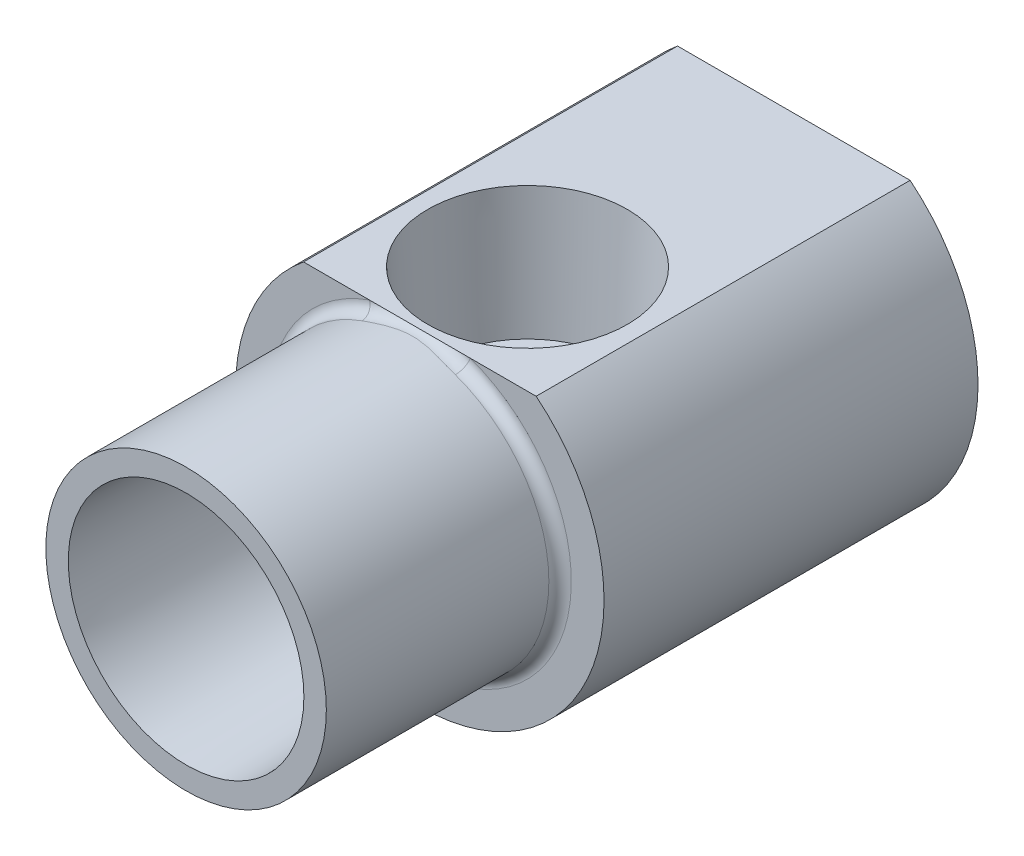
ISO-10303-21;
HEADER;
FILE_DESCRIPTION(('STEP AP214'),'2;1');
FILE_NAME('part.step','',(''),(''),'','','');
FILE_SCHEMA(('AUTOMOTIVE_DESIGN { 1 0 10303 214 1 1 1 1 }'));
ENDSEC;
DATA;
#1=APPLICATION_CONTEXT('core data for automotive mechanical design processes');
#2=APPLICATION_PROTOCOL_DEFINITION('international standard','automotive_design',2000,#1);
#3=PRODUCT_CONTEXT('',#1,'mechanical');
#4=PRODUCT('Part','Part','',(#3));
#5=PRODUCT_RELATED_PRODUCT_CATEGORY('part','',(#4));
#6=PRODUCT_DEFINITION_FORMATION('','',#4);
#7=PRODUCT_DEFINITION_CONTEXT('part definition',#1,'design');
#8=PRODUCT_DEFINITION('design','',#6,#7);
#9=PRODUCT_DEFINITION_SHAPE('','',#8);
#10=(LENGTH_UNIT() NAMED_UNIT(*) SI_UNIT(.MILLI.,.METRE.));
#11=(NAMED_UNIT(*) PLANE_ANGLE_UNIT() SI_UNIT($,.RADIAN.));
#12=(NAMED_UNIT(*) SI_UNIT($,.STERADIAN.) SOLID_ANGLE_UNIT());
#13=UNCERTAINTY_MEASURE_WITH_UNIT(LENGTH_MEASURE(1.E-05),#10,'distance_accuracy_value','');
#14=(GEOMETRIC_REPRESENTATION_CONTEXT(3) GLOBAL_UNCERTAINTY_ASSIGNED_CONTEXT((#13)) GLOBAL_UNIT_ASSIGNED_CONTEXT((#10,
#11,#12)) REPRESENTATION_CONTEXT('',''));
#15=CARTESIAN_POINT('',(0.,0.,0.));
#16=DIRECTION('',(0.,0.,1.));
#17=DIRECTION('',(1.,0.,0.));
#18=AXIS2_PLACEMENT_3D('',#15,#16,#17);
#19=CARTESIAN_POINT('',(-7.29488,0.,-13.462));
#20=DIRECTION('',(0.,0.,1.));
#21=DIRECTION('',(1.,0.,0.));
#22=AXIS2_PLACEMENT_3D('',#19,#20,#21);
#23=PLANE('',#22);
#24=CARTESIAN_POINT('',(0.,0.233282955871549,-13.462));
#25=DIRECTION('',(0.,0.,1.));
#26=DIRECTION('',(0.,1.,0.));
#27=AXIS2_PLACEMENT_3D('',#24,#25,#26);
#28=ELLIPSE('',#27,5.59241597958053,4.80582945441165);
#29=CARTESIAN_POINT('',(0.,5.82569893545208,-13.462));
#30=VERTEX_POINT('',#29);
#31=EDGE_CURVE('E338',#30,#30,#28,.F.);
#32=ORIENTED_EDGE('',*,*,#31,.T.);
#33=EDGE_LOOP('',(#32));
#34=FACE_BOUND('',#33,.T.);
#35=CARTESIAN_POINT('',(0.,0.,-13.462));
#36=DIRECTION('',(0.,0.,1.));
#37=DIRECTION('',(1.,0.,0.));
#38=AXIS2_PLACEMENT_3D('',#35,#36,#37);
#39=CIRCLE('',#38,7.59792969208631);
#40=CARTESIAN_POINT('',(7.59792969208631,0.,-13.462));
#41=VERTEX_POINT('',#40);
#42=EDGE_CURVE('E242',#41,#41,#39,.T.);
#43=ORIENTED_EDGE('',*,*,#42,.T.);
#44=EDGE_LOOP('',(#43));
#45=FACE_BOUND('',#44,.T.);
#46=ADVANCED_FACE('F16',(#34,#45),#23,.T.);
#47=CARTESIAN_POINT('',(-7.29488,0.,0.));
#48=DIRECTION('',(0.,0.,1.));
#49=DIRECTION('',(1.,0.,0.));
#50=AXIS2_PLACEMENT_3D('',#47,#48,#49);
#51=PLANE('',#50);
#52=CARTESIAN_POINT('',(0.,0.,0.));
#53=DIRECTION('',(0.,0.,1.));
#54=DIRECTION('',(1.,0.,0.));
#55=AXIS2_PLACEMENT_3D('',#52,#53,#54);
#56=CIRCLE('',#55,8.001);
#57=CARTESIAN_POINT('',(8.001,0.,0.));
#58=VERTEX_POINT('',#57);
#59=EDGE_CURVE('E245',#58,#58,#56,.T.);
#60=ORIENTED_EDGE('',*,*,#59,.F.);
#61=EDGE_LOOP('',(#60));
#62=FACE_BOUND('',#61,.T.);
#63=CARTESIAN_POINT('',(0.,0.,0.));
#64=DIRECTION('',(0.,0.,1.));
#65=DIRECTION('',(1.,0.,0.));
#66=AXIS2_PLACEMENT_3D('',#63,#64,#65);
#67=CIRCLE('',#66,9.525);
#68=CARTESIAN_POINT('',(9.525,0.,0.));
#69=VERTEX_POINT('',#68);
#70=EDGE_CURVE('E231',#69,#69,#67,.T.);
#71=ORIENTED_EDGE('',*,*,#70,.T.);
#72=EDGE_LOOP('',(#71));
#73=FACE_BOUND('',#72,.T.);
#74=ADVANCED_FACE('F299',(#62,#73),#51,.T.);
#75=CARTESIAN_POINT('',(-12.5095,0.,-41.275));
#76=DIRECTION('',(0.,0.,-1.));
#77=DIRECTION('',(-1.,0.,0.));
#78=AXIS2_PLACEMENT_3D('',#75,#76,#77);
#79=PLANE('',#78);
#80=DIRECTION('',(1.,0.,0.));
#81=VECTOR('',#80,1.);
#82=CARTESIAN_POINT('',(-3.66617420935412,6.35,-41.275));
#83=LINE('',#82,#81);
#84=CARTESIAN_POINT('',(-3.66617420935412,6.35,-41.275));
#85=VERTEX_POINT('',#84);
#86=CARTESIAN_POINT('',(3.66617420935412,6.35,-41.275));
#87=VERTEX_POINT('',#86);
#88=EDGE_CURVE('E339',#85,#87,#83,.T.);
#89=ORIENTED_EDGE('',*,*,#88,.F.);
#90=DIRECTION('',(0.5,0.866025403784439,0.));
#91=VECTOR('',#90,1.);
#92=CARTESIAN_POINT('',(-7.33234841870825,0.,-41.275));
#93=LINE('',#92,#91);
#94=CARTESIAN_POINT('',(-7.33234841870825,0.,-41.275));
#95=VERTEX_POINT('',#94);
#96=EDGE_CURVE('E366',#95,#85,#93,.T.);
#97=ORIENTED_EDGE('',*,*,#96,.F.);
#98=DIRECTION('',(-0.5,0.866025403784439,0.));
#99=VECTOR('',#98,1.);
#100=CARTESIAN_POINT('',(-3.66617420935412,-6.35,-41.275));
#101=LINE('',#100,#99);
#102=CARTESIAN_POINT('',(-3.66617420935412,-6.35,-41.275));
#103=VERTEX_POINT('',#102);
#104=EDGE_CURVE('E363',#103,#95,#101,.T.);
#105=ORIENTED_EDGE('',*,*,#104,.F.);
#106=DIRECTION('',(-1.,0.,0.));
#107=VECTOR('',#106,1.);
#108=CARTESIAN_POINT('',(3.66617420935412,-6.35,-41.275));
#109=LINE('',#108,#107);
#110=CARTESIAN_POINT('',(3.66617420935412,-6.35,-41.275));
#111=VERTEX_POINT('',#110);
#112=EDGE_CURVE('E360',#111,#103,#109,.T.);
#113=ORIENTED_EDGE('',*,*,#112,.F.);
#114=DIRECTION('',(-0.5,-0.866025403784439,0.));
#115=VECTOR('',#114,1.);
#116=CARTESIAN_POINT('',(7.33234841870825,0.,-41.275));
#117=LINE('',#116,#115);
#118=CARTESIAN_POINT('',(7.33234841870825,0.,-41.275));
#119=VERTEX_POINT('',#118);
#120=EDGE_CURVE('E352',#119,#111,#117,.T.);
#121=ORIENTED_EDGE('',*,*,#120,.F.);
#122=DIRECTION('',(0.5,-0.866025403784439,0.));
#123=VECTOR('',#122,1.);
#124=CARTESIAN_POINT('',(3.66617420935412,6.35,-41.275));
#125=LINE('',#124,#123);
#126=EDGE_CURVE('E341',#87,#119,#125,.T.);
#127=ORIENTED_EDGE('',*,*,#126,.F.);
#128=EDGE_LOOP('',(#89,#97,#105,#113,#121,#127));
#129=FACE_BOUND('',#128,.T.);
#130=DIRECTION('',(-1.,0.,0.));
#131=VECTOR('',#130,1.);
#132=CARTESIAN_POINT('',(-7.8994,9.69984896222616,-41.275));
#133=LINE('',#132,#131);
#134=CARTESIAN_POINT('',(7.8994,9.69984896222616,-41.275));
#135=VERTEX_POINT('',#134);
#136=CARTESIAN_POINT('',(-7.8994,9.69984896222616,-41.275));
#137=VERTEX_POINT('',#136);
#138=EDGE_CURVE('E332',#135,#137,#133,.T.);
#139=ORIENTED_EDGE('',*,*,#138,.F.);
#140=CARTESIAN_POINT('',(0.,0.,-41.275));
#141=DIRECTION('',(0.,0.,-1.));
#142=DIRECTION('',(-1.,0.,0.));
#143=AXIS2_PLACEMENT_3D('',#140,#141,#142);
#144=CIRCLE('',#143,12.5095);
#145=EDGE_CURVE('E324',#135,#137,#144,.T.);
#146=ORIENTED_EDGE('',*,*,#145,.T.);
#147=EDGE_LOOP('',(#139,#146));
#148=FACE_BOUND('',#147,.T.);
#149=ADVANCED_FACE('F305',(#129,#148),#79,.T.);
#150=CARTESIAN_POINT('',(0.,0.,-75.1971669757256));
#151=DIRECTION('',(0.,0.,-1.));
#152=DIRECTION('',(-1.,0.,0.));
#153=AXIS2_PLACEMENT_3D('',#150,#151,#152);
#154=CYLINDRICAL_SURFACE('',#153,12.5095);
#155=DIRECTION('',(0.,0.,-1.));
#156=VECTOR('',#155,1.);
#157=CARTESIAN_POINT('',(-7.8994,9.69984896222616,0.));
#158=LINE('',#157,#156);
#159=CARTESIAN_POINT('',(-7.8994,9.69984896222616,-15.875));
#160=VERTEX_POINT('',#159);
#161=EDGE_CURVE('E321',#160,#137,#158,.T.);
#162=ORIENTED_EDGE('',*,*,#161,.T.);
#163=ORIENTED_EDGE('',*,*,#145,.F.);
#164=DIRECTION('',(0.,0.,-1.));
#165=VECTOR('',#164,1.);
#166=CARTESIAN_POINT('',(7.8994,9.69984896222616,0.));
#167=LINE('',#166,#165);
#168=CARTESIAN_POINT('',(7.8994,9.69984896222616,-15.875));
#169=VERTEX_POINT('',#168);
#170=EDGE_CURVE('E328',#169,#135,#167,.T.);
#171=ORIENTED_EDGE('',*,*,#170,.F.);
#172=CARTESIAN_POINT('',(0.,0.,-15.875));
#173=DIRECTION('',(0.,0.,-1.));
#174=DIRECTION('',(-1.,0.,0.));
#175=AXIS2_PLACEMENT_3D('',#172,#173,#174);
#176=CIRCLE('',#175,12.5095);
#177=EDGE_CURVE('E326',#169,#160,#176,.T.);
#178=ORIENTED_EDGE('',*,*,#177,.T.);
#179=EDGE_LOOP('',(#162,#163,#171,#178));
#180=FACE_BOUND('',#179,.T.);
#181=ADVANCED_FACE('F311',(#180),#154,.T.);
#182=CARTESIAN_POINT('',(-8.89,0.,-15.875));
#183=DIRECTION('',(0.,0.,1.));
#184=DIRECTION('',(1.,0.,0.));
#185=AXIS2_PLACEMENT_3D('',#182,#183,#184);
#186=PLANE('',#185);
#187=DIRECTION('',(1.,0.,0.));
#188=VECTOR('',#187,1.);
#189=CARTESIAN_POINT('',(-8.89,9.69984896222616,-15.875));
#190=LINE('',#189,#188);
#191=CARTESIAN_POINT('',(3.42568228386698,9.69984896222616,-15.875));
#192=VERTEX_POINT('',#191);
#193=EDGE_CURVE('E333',#192,#169,#190,.T.);
#194=ORIENTED_EDGE('',*,*,#193,.F.);
#195=CARTESIAN_POINT('',(0.,0.,-15.875));
#196=DIRECTION('',(0.,0.,1.));
#197=DIRECTION('',(1.,0.,0.));
#198=AXIS2_PLACEMENT_3D('',#195,#196,#197);
#199=CIRCLE('',#198,10.287);
#200=CARTESIAN_POINT('',(-3.42568228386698,9.69984896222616,-15.875));
#201=VERTEX_POINT('',#200);
#202=EDGE_CURVE('E10',#192,#201,#199,.F.);
#203=ORIENTED_EDGE('',*,*,#202,.T.);
#204=EDGE_CURVE('E136',#160,#201,#190,.T.);
#205=ORIENTED_EDGE('',*,*,#204,.F.);
#206=ORIENTED_EDGE('',*,*,#177,.F.);
#207=EDGE_LOOP('',(#194,#203,#205,#206));
#208=FACE_BOUND('',#207,.T.);
#209=ADVANCED_FACE('F223',(#208),#186,.T.);
#210=CARTESIAN_POINT('',(-7.8994,9.69984896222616,0.));
#211=DIRECTION('',(0.,-1.,0.));
#212=DIRECTION('',(0.,0.,-1.));
#213=AXIS2_PLACEMENT_3D('',#210,#211,#212);
#214=PLANE('',#213);
#215=CARTESIAN_POINT('',(0.,9.69984896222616,-23.1902));
#216=DIRECTION('',(0.,-1.,0.));
#217=DIRECTION('',(0.,0.,-1.));
#218=AXIS2_PLACEMENT_3D('',#215,#216,#217);
#219=CIRCLE('',#218,6.774788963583);
#220=CARTESIAN_POINT('',(0.,9.69984896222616,-29.964988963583));
#221=VERTEX_POINT('',#220);
#222=EDGE_CURVE('E144',#221,#221,#219,.T.);
#223=ORIENTED_EDGE('',*,*,#222,.T.);
#224=EDGE_LOOP('',(#223));
#225=FACE_BOUND('',#224,.T.);
#226=ORIENTED_EDGE('',*,*,#204,.T.);
#227=EDGE_CURVE('E236',#201,#192,#190,.T.);
#228=ORIENTED_EDGE('',*,*,#227,.T.);
#229=ORIENTED_EDGE('',*,*,#193,.T.);
#230=ORIENTED_EDGE('',*,*,#170,.T.);
#231=ORIENTED_EDGE('',*,*,#138,.T.);
#232=ORIENTED_EDGE('',*,*,#161,.F.);
#233=EDGE_LOOP('',(#226,#228,#229,#230,#231,#232));
#234=FACE_BOUND('',#233,.T.);
#235=ADVANCED_FACE('F226',(#225,#234),#214,.F.);
#236=CARTESIAN_POINT('',(-3.66617420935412,6.35,-34.925));
#237=DIRECTION('',(0.,1.,0.));
#238=DIRECTION('',(-1.,0.,0.));
#239=AXIS2_PLACEMENT_3D('',#236,#237,#238);
#240=PLANE('',#239);
#241=ORIENTED_EDGE('',*,*,#88,.T.);
#242=DIRECTION('',(0.,0.,-1.));
#243=VECTOR('',#242,1.);
#244=CARTESIAN_POINT('',(3.66617420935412,6.35,-34.925));
#245=LINE('',#244,#243);
#246=CARTESIAN_POINT('',(3.66617420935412,6.35,-34.925));
#247=VERTEX_POINT('',#246);
#248=EDGE_CURVE('E380',#247,#87,#245,.T.);
#249=ORIENTED_EDGE('',*,*,#248,.F.);
#250=DIRECTION('',(1.,0.,0.));
#251=VECTOR('',#250,1.);
#252=CARTESIAN_POINT('',(-3.66617420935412,6.35,-34.925));
#253=LINE('',#252,#251);
#254=CARTESIAN_POINT('',(-3.66617420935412,6.35,-34.925));
#255=VERTEX_POINT('',#254);
#256=EDGE_CURVE('E369',#255,#247,#253,.T.);
#257=ORIENTED_EDGE('',*,*,#256,.F.);
#258=DIRECTION('',(0.,0.,-1.));
#259=VECTOR('',#258,1.);
#260=CARTESIAN_POINT('',(-3.66617420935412,6.35,-34.925));
#261=LINE('',#260,#259);
#262=EDGE_CURVE('E370',#255,#85,#261,.T.);
#263=ORIENTED_EDGE('',*,*,#262,.T.);
#264=EDGE_LOOP('',(#241,#249,#257,#263));
#265=FACE_BOUND('',#264,.T.);
#266=ADVANCED_FACE('F276',(#265),#240,.F.);
#267=CARTESIAN_POINT('',(-7.33234841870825,0.,-34.925));
#268=DIRECTION('',(-0.866025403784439,0.5,0.));
#269=DIRECTION('',(-0.5,-0.866025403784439,0.));
#270=AXIS2_PLACEMENT_3D('',#267,#268,#269);
#271=PLANE('',#270);
#272=ORIENTED_EDGE('',*,*,#96,.T.);
#273=ORIENTED_EDGE('',*,*,#262,.F.);
#274=DIRECTION('',(0.5,0.866025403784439,0.));
#275=VECTOR('',#274,1.);
#276=CARTESIAN_POINT('',(-7.33234841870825,0.,-34.925));
#277=LINE('',#276,#275);
#278=CARTESIAN_POINT('',(-7.33234841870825,0.,-34.925));
#279=VERTEX_POINT('',#278);
#280=EDGE_CURVE('E355',#279,#255,#277,.T.);
#281=ORIENTED_EDGE('',*,*,#280,.F.);
#282=DIRECTION('',(0.,0.,-1.));
#283=VECTOR('',#282,1.);
#284=CARTESIAN_POINT('',(-7.33234841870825,0.,-34.925));
#285=LINE('',#284,#283);
#286=EDGE_CURVE('E372',#279,#95,#285,.T.);
#287=ORIENTED_EDGE('',*,*,#286,.T.);
#288=EDGE_LOOP('',(#272,#273,#281,#287));
#289=FACE_BOUND('',#288,.T.);
#290=ADVANCED_FACE('F272',(#289),#271,.F.);
#291=CARTESIAN_POINT('',(-3.66617420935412,-6.35,-34.925));
#292=DIRECTION('',(-0.866025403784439,-0.5,0.));
#293=DIRECTION('',(0.5,-0.866025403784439,0.));
#294=AXIS2_PLACEMENT_3D('',#291,#292,#293);
#295=PLANE('',#294);
#296=ORIENTED_EDGE('',*,*,#104,.T.);
#297=ORIENTED_EDGE('',*,*,#286,.F.);
#298=DIRECTION('',(-0.5,0.866025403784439,0.));
#299=VECTOR('',#298,1.);
#300=CARTESIAN_POINT('',(-3.66617420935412,-6.35,-34.925));
#301=LINE('',#300,#299);
#302=CARTESIAN_POINT('',(-3.66617420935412,-6.35,-34.925));
#303=VERTEX_POINT('',#302);
#304=EDGE_CURVE('E385',#303,#279,#301,.T.);
#305=ORIENTED_EDGE('',*,*,#304,.F.);
#306=DIRECTION('',(0.,0.,-1.));
#307=VECTOR('',#306,1.);
#308=CARTESIAN_POINT('',(-3.66617420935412,-6.35,-34.925));
#309=LINE('',#308,#307);
#310=EDGE_CURVE('E374',#303,#103,#309,.T.);
#311=ORIENTED_EDGE('',*,*,#310,.T.);
#312=EDGE_LOOP('',(#296,#297,#305,#311));
#313=FACE_BOUND('',#312,.T.);
#314=ADVANCED_FACE('F275',(#313),#295,.F.);
#315=CARTESIAN_POINT('',(3.66617420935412,-6.35,-34.925));
#316=DIRECTION('',(0.,-1.,0.));
#317=DIRECTION('',(1.,0.,0.));
#318=AXIS2_PLACEMENT_3D('',#315,#316,#317);
#319=PLANE('',#318);
#320=ORIENTED_EDGE('',*,*,#112,.T.);
#321=ORIENTED_EDGE('',*,*,#310,.F.);
#322=DIRECTION('',(-1.,0.,0.));
#323=VECTOR('',#322,1.);
#324=CARTESIAN_POINT('',(3.66617420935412,-6.35,-34.925));
#325=LINE('',#324,#323);
#326=CARTESIAN_POINT('',(3.66617420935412,-6.35,-34.925));
#327=VERTEX_POINT('',#326);
#328=EDGE_CURVE('E389',#327,#303,#325,.T.);
#329=ORIENTED_EDGE('',*,*,#328,.F.);
#330=DIRECTION('',(0.,0.,-1.));
#331=VECTOR('',#330,1.);
#332=CARTESIAN_POINT('',(3.66617420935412,-6.35,-34.925));
#333=LINE('',#332,#331);
#334=EDGE_CURVE('E376',#327,#111,#333,.T.);
#335=ORIENTED_EDGE('',*,*,#334,.T.);
#336=EDGE_LOOP('',(#320,#321,#329,#335));
#337=FACE_BOUND('',#336,.T.);
#338=ADVANCED_FACE('F280',(#337),#319,.F.);
#339=CARTESIAN_POINT('',(7.33234841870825,0.,-34.925));
#340=DIRECTION('',(0.866025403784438,-0.5,0.));
#341=DIRECTION('',(0.5,0.866025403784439,0.));
#342=AXIS2_PLACEMENT_3D('',#339,#340,#341);
#343=PLANE('',#342);
#344=ORIENTED_EDGE('',*,*,#120,.T.);
#345=ORIENTED_EDGE('',*,*,#334,.F.);
#346=DIRECTION('',(-0.5,-0.866025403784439,0.));
#347=VECTOR('',#346,1.);
#348=CARTESIAN_POINT('',(7.33234841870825,0.,-34.925));
#349=LINE('',#348,#347);
#350=CARTESIAN_POINT('',(7.33234841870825,0.,-34.925));
#351=VERTEX_POINT('',#350);
#352=EDGE_CURVE('E392',#351,#327,#349,.T.);
#353=ORIENTED_EDGE('',*,*,#352,.F.);
#354=DIRECTION('',(0.,0.,-1.));
#355=VECTOR('',#354,1.);
#356=CARTESIAN_POINT('',(7.33234841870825,0.,-34.925));
#357=LINE('',#356,#355);
#358=EDGE_CURVE('E378',#351,#119,#357,.T.);
#359=ORIENTED_EDGE('',*,*,#358,.T.);
#360=EDGE_LOOP('',(#344,#345,#353,#359));
#361=FACE_BOUND('',#360,.T.);
#362=ADVANCED_FACE('F284',(#361),#343,.F.);
#363=CARTESIAN_POINT('',(3.66617420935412,6.35,-34.925));
#364=DIRECTION('',(0.866025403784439,0.5,0.));
#365=DIRECTION('',(-0.5,0.866025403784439,0.));
#366=AXIS2_PLACEMENT_3D('',#363,#364,#365);
#367=PLANE('',#366);
#368=ORIENTED_EDGE('',*,*,#126,.T.);
#369=ORIENTED_EDGE('',*,*,#358,.F.);
#370=DIRECTION('',(0.5,-0.866025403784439,0.));
#371=VECTOR('',#370,1.);
#372=CARTESIAN_POINT('',(3.66617420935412,6.35,-34.925));
#373=LINE('',#372,#371);
#374=EDGE_CURVE('E397',#247,#351,#373,.T.);
#375=ORIENTED_EDGE('',*,*,#374,.F.);
#376=ORIENTED_EDGE('',*,*,#248,.T.);
#377=EDGE_LOOP('',(#368,#369,#375,#376));
#378=FACE_BOUND('',#377,.T.);
#379=ADVANCED_FACE('F270',(#378),#367,.F.);
#380=CARTESIAN_POINT('',(0.,0.,-34.925));
#381=DIRECTION('',(0.,0.,-1.));
#382=DIRECTION('',(-1.,0.,0.));
#383=AXIS2_PLACEMENT_3D('',#380,#381,#382);
#384=PLANE('',#383);
#385=ORIENTED_EDGE('',*,*,#256,.T.);
#386=ORIENTED_EDGE('',*,*,#374,.T.);
#387=ORIENTED_EDGE('',*,*,#352,.T.);
#388=ORIENTED_EDGE('',*,*,#328,.T.);
#389=ORIENTED_EDGE('',*,*,#304,.T.);
#390=ORIENTED_EDGE('',*,*,#280,.T.);
#391=EDGE_LOOP('',(#385,#386,#387,#388,#389,#390));
#392=FACE_BOUND('',#391,.T.);
#393=ADVANCED_FACE('F266',(#392),#384,.T.);
#394=CARTESIAN_POINT('',(0.,-6.00581530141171,-22.9455880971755));
#395=DIRECTION('',(0.,0.493966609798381,0.869480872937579));
#396=DIRECTION('',(0.,-0.869480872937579,0.493966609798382));
#397=AXIS2_PLACEMENT_3D('',#394,#395,#396);
#398=CONICAL_SURFACE('',#397,1.8272494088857,1.04024469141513);
#399=CARTESIAN_POINT('',(-1.82744940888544,-5.03807735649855,-23.3149062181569));
#400=CARTESIAN_POINT('',(-1.7867215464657,-5.06094159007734,-23.3299883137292));
#401=CARTESIAN_POINT('',(-1.74593824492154,-5.0836922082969,-23.3450942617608));
#402=CARTESIAN_POINT('',(-1.66422690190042,-5.1289025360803,-23.3753594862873));
#403=CARTESIAN_POINT('',(-1.62329885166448,-5.15136222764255,-23.390518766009));
#404=CARTESIAN_POINT('',(-1.50006110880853,-5.21831012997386,-23.4361537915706));
#405=CARTESIAN_POINT('',(-1.41748938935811,-5.26225884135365,-23.46671571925));
#406=CARTESIAN_POINT('',(-1.24868945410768,-5.34917568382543,-23.5290319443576));
#407=CARTESIAN_POINT('',(-1.16242670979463,-5.39207254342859,-23.5607940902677));
#408=CARTESIAN_POINT('',(-1.03156273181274,-5.45317848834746,-23.6084355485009));
#409=CARTESIAN_POINT('',(-0.987715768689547,-5.47299934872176,-23.6243088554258));
#410=CARTESIAN_POINT('',(-0.899357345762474,-5.51118722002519,-23.6559453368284));
#411=CARTESIAN_POINT('',(-0.854845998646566,-5.52955447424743,-23.6717085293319));
#412=CARTESIAN_POINT('',(-0.76921296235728,-5.56271504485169,-23.7014228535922));
#413=CARTESIAN_POINT('',(-0.728169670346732,-5.57768209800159,-23.7154041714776));
#414=CARTESIAN_POINT('',(-0.645195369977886,-5.60561336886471,-23.7427706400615));
#415=CARTESIAN_POINT('',(-0.603264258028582,-5.61857735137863,-23.7561557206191));
#416=CARTESIAN_POINT('',(-0.518641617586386,-5.641986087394,-23.7816928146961));
#417=CARTESIAN_POINT('',(-0.475956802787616,-5.65244666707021,-23.7938522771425));
#418=CARTESIAN_POINT('',(-0.389494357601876,-5.67061749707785,-23.8162115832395));
#419=CARTESIAN_POINT('',(-0.34571709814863,-5.67832866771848,-23.8264120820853));
#420=CARTESIAN_POINT('',(-0.266721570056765,-5.68951680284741,-23.841947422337));
#421=CARTESIAN_POINT('',(-0.231696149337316,-5.69354850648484,-23.8478572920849));
#422=CARTESIAN_POINT('',(-0.16117435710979,-5.69986270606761,-23.8573615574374));
#423=CARTESIAN_POINT('',(-0.125678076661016,-5.70214553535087,-23.8609563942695));
#424=CARTESIAN_POINT('',(-0.054543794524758,-5.70500060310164,-23.865486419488));
#425=CARTESIAN_POINT('',(-0.0189064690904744,-5.70557761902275,-23.8664290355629));
#426=CARTESIAN_POINT('',(0.0523250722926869,-5.70505066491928,-23.8655808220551));
#427=CARTESIAN_POINT('',(0.0879192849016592,-5.70394657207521,-23.8637897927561));
#428=CARTESIAN_POINT('',(0.158494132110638,-5.70004503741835,-23.8576776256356));
#429=CARTESIAN_POINT('',(0.19347740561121,-5.69726160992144,-23.85337743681));
#430=CARTESIAN_POINT('',(0.262928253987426,-5.68997359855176,-23.8426456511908));
#431=CARTESIAN_POINT('',(0.297395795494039,-5.68546890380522,-23.8362139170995));
#432=CARTESIAN_POINT('',(0.366093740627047,-5.67467661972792,-23.8216177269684));
#433=CARTESIAN_POINT('',(0.400316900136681,-5.66836919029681,-23.8134342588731));
#434=CARTESIAN_POINT('',(0.468079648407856,-5.65407475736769,-23.7958669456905));
#435=CARTESIAN_POINT('',(0.501619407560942,-5.64608817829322,-23.7864834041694));
#436=CARTESIAN_POINT('',(0.594678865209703,-5.6215681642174,-23.7591031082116));
#437=CARTESIAN_POINT('',(0.653484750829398,-5.603313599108,-23.7402287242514));
#438=CARTESIAN_POINT('',(0.769466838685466,-5.56301798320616,-23.7014874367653));
#439=CARTESIAN_POINT('',(0.826641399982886,-5.5409732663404,-23.681619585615));
#440=CARTESIAN_POINT('',(0.94004012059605,-5.49412082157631,-23.6414953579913));
#441=CARTESIAN_POINT('',(0.99625857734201,-5.46930064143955,-23.621237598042));
#442=CARTESIAN_POINT('',(1.10780540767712,-5.41781838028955,-23.5807131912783));
#443=CARTESIAN_POINT('',(1.16313409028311,-5.39115695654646,-23.5604465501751));
#444=CARTESIAN_POINT('',(1.26994740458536,-5.33814574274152,-23.5211792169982));
#445=CARTESIAN_POINT('',(1.32146709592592,-5.31186946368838,-23.5021740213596));
#446=CARTESIAN_POINT('',(1.42411095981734,-5.25848290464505,-23.4642532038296));
#447=CARTESIAN_POINT('',(1.47523509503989,-5.23137254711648,-23.4453375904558));
#448=CARTESIAN_POINT('',(1.57666925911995,-5.17681631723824,-23.4077887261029));
#449=CARTESIAN_POINT('',(1.62698228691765,-5.14937663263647,-23.3891545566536));
#450=CARTESIAN_POINT('',(1.72737333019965,-5.09403821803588,-23.3519703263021));
#451=CARTESIAN_POINT('',(1.77745138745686,-5.06613957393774,-23.3334202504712));
#452=CARTESIAN_POINT('',(1.82744940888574,-5.0380773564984,-23.3149062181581));
#453=B_SPLINE_CURVE_WITH_KNOTS('',3,(#399,#400,#401,#402,#403,#404,#405,#406,#407,#408,#409,
#410,#411,#412,#413,#414,#415,#416,#417,#418,#419,#420,#421,#422,#423,#424,#425,#426,#427,#428,
#429,#430,#431,#432,#433,#434,#435,#436,#437,#438,#439,#440,#441,#442,#443,#444,#445,#446,#447,
#448,#449,#450,#451,#452),.UNSPECIFIED.,.F.,.F.,(4,2,2,2,2,2,2,2,2,2,2,2,2,2,2,2,2,2,2,2,2,2,2,
2,2,2,4),(0.,0.147245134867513,0.29449933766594,0.589701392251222,0.893945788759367,
1.04593617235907,1.1979010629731,1.33546836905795,1.47305181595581,1.60974103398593,
1.74638445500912,1.85352454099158,1.960644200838,2.06746356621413,2.17429073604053,
2.28023851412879,2.38619311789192,2.49336194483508,2.600503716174,2.79348380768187,
2.98665162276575,3.18072377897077,3.37472701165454,3.55734659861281,3.7399832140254,
3.920768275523,4.10151987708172),.UNSPECIFIED.);
#454=CARTESIAN_POINT('',(-1.56363388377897,-5.18375827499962,-23.4126124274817));
#455=VERTEX_POINT('',#454);
#456=CARTESIAN_POINT('',(1.56363388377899,-5.18375827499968,-23.4126124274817));
#457=VERTEX_POINT('',#456);
#458=EDGE_CURVE('E255',#455,#457,#453,.T.);
#459=ORIENTED_EDGE('',*,*,#458,.F.);
#460=CARTESIAN_POINT('',(0.,-6.00581530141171,-22.9455880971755));
#461=DIRECTION('',(0.,-0.493966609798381,-0.869480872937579));
#462=DIRECTION('',(0.,0.869480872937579,-0.493966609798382));
#463=AXIS2_PLACEMENT_3D('',#460,#461,#462);
#464=CIRCLE('',#463,1.8272494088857);
#465=EDGE_CURVE('E260',#457,#455,#464,.T.);
#466=ORIENTED_EDGE('',*,*,#465,.F.);
#467=EDGE_LOOP('',(#459,#466));
#468=FACE_BOUND('',#467,.T.);
#469=CARTESIAN_POINT('',(0.,-6.53533316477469,-23.8776463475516));
#470=VERTEX_POINT('',#469);
#471=VERTEX_LOOP('',#470);
#472=FACE_BOUND('',#471,.T.);
#473=ADVANCED_FACE('F262',(#468,#472),#398,.F.);
#474=CARTESIAN_POINT('',(0.,0.989120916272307,-10.6330893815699));
#475=DIRECTION('',(0.,0.493966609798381,0.869480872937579));
#476=DIRECTION('',(0.,-0.869480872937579,0.493966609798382));
#477=AXIS2_PLACEMENT_3D('',#474,#475,#476);
#478=CONICAL_SURFACE('',#477,5.62161014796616,0.261799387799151);
#479=CARTESIAN_POINT('',(1.31407249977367,-5.24708172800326,-23.8483882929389));
#480=CARTESIAN_POINT('',(1.33999010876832,-5.24369445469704,-23.8097611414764));
#481=CARTESIAN_POINT('',(1.36498705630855,-5.23965924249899,-23.7705905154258));
#482=CARTESIAN_POINT('',(1.41330462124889,-5.23024588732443,-23.6914104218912));
#483=CARTESIAN_POINT('',(1.43662603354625,-5.22486838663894,-23.6514013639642));
#484=CARTESIAN_POINT('',(1.50420195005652,-5.20668868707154,-23.5307141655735));
#485=CARTESIAN_POINT('',(1.54624684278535,-5.19181625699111,-23.4491026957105));
#486=CARTESIAN_POINT('',(1.62526155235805,-5.15692729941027,-23.2858158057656));
#487=CARTESIAN_POINT('',(1.66228545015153,-5.13697360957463,-23.2041525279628));
#488=CARTESIAN_POINT('',(1.71530330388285,-5.10356374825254,-23.0815055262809));
#489=CARTESIAN_POINT('',(1.7325630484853,-5.09184152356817,-23.040580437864));
#490=CARTESIAN_POINT('',(1.76635510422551,-5.0673308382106,-22.9587507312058));
#491=CARTESIAN_POINT('',(1.78288744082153,-5.05454241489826,-22.9178461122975));
#492=CARTESIAN_POINT('',(1.83057234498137,-5.01552544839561,-22.7977226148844));
#493=CARTESIAN_POINT('',(1.86087317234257,-4.98795453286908,-22.71860067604));
#494=CARTESIAN_POINT('',(1.91978108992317,-4.9298301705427,-22.5608156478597));
#495=CARTESIAN_POINT('',(1.94838776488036,-4.89927599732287,-22.4821526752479));
#496=CARTESIAN_POINT('',(2.0043784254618,-4.83575630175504,-22.3252883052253));
#497=CARTESIAN_POINT('',(2.03176137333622,-4.80278879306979,-22.2470873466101));
#498=CARTESIAN_POINT('',(2.08560507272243,-4.73494501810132,-22.0911946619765));
#499=CARTESIAN_POINT('',(2.11206574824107,-4.70006859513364,-22.0135029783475));
#500=CARTESIAN_POINT('',(2.19057305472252,-4.59298364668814,-21.7807033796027));
#501=CARTESIAN_POINT('',(2.24159462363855,-4.51849785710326,-21.6262997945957));
#502=CARTESIAN_POINT('',(2.3420488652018,-4.36567705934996,-21.3190112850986));
#503=CARTESIAN_POINT('',(2.39148225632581,-4.28734383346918,-21.1661256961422));
#504=CARTESIAN_POINT('',(2.49004661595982,-4.1269836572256,-20.8593452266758));
#505=CARTESIAN_POINT('',(2.53916436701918,-4.04492099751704,-20.7054648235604));
#506=CARTESIAN_POINT('',(2.6367682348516,-3.87893598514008,-20.3984913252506));
#507=CARTESIAN_POINT('',(2.68525428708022,-3.7950134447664,-20.245398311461));
#508=CARTESIAN_POINT('',(2.78172802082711,-3.62596665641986,-19.9400324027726));
#509=CARTESIAN_POINT('',(2.82971632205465,-3.54084432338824,-19.7877586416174));
#510=CARTESIAN_POINT('',(2.92539484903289,-3.369628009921,-19.4836643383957));
#511=CARTESIAN_POINT('',(2.97308507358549,-3.28353402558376,-19.3318437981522));
#512=CARTESIAN_POINT('',(3.04900074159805,-3.14558942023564,-19.0899011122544));
#513=CARTESIAN_POINT('',(3.07729576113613,-3.09397563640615,-18.9996655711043));
#514=CARTESIAN_POINT('',(3.133684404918,-2.99077406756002,-18.8197397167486));
#515=CARTESIAN_POINT('',(3.16177834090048,-2.93918736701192,-18.7300488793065));
#516=CARTESIAN_POINT('',(3.18984619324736,-2.88750711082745,-18.6404038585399));
#517=B_SPLINE_CURVE_WITH_KNOTS('',3,(#479,#480,#481,#482,#483,#484,#485,#486,#487,#488,#489,
#490,#491,#492,#493,#494,#495,#496,#497,#498,#499,#500,#501,#502,#503,#504,#505,#506,#507,#508,
#509,#510,#511,#512,#513,#514,#515,#516),.UNSPECIFIED.,.F.,.F.,(4,2,2,2,2,2,2,2,2,2,2,2,2,2,2,2,
2,2,4),(0.,0.139879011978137,0.279691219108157,0.558337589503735,0.833692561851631,
0.971487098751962,1.10927680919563,1.37647813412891,1.64374468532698,1.91123374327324,
2.17874478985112,2.71523041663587,3.25146982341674,3.79498947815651,4.33856423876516,
4.88135231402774,5.42414256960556,5.74735027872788,6.06899283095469),.UNSPECIFIED.);
#518=CARTESIAN_POINT('',(3.18973757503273,-2.88770711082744,-18.6407507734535));
#519=VERTEX_POINT('',#518);
#520=EDGE_CURVE('E191',#457,#519,#517,.T.);
#521=ORIENTED_EDGE('',*,*,#520,.F.);
#522=ORIENTED_EDGE('',*,*,#465,.T.);
#523=CARTESIAN_POINT('',(-3.18984619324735,-2.88750711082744,-18.6404038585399));
#524=CARTESIAN_POINT('',(-3.13267735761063,-2.99272756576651,-18.8229727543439));
#525=CARTESIAN_POINT('',(-3.07541676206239,-3.09760237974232,-19.0057149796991));
#526=CARTESIAN_POINT('',(-2.96055123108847,-3.30629481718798,-19.3717871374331));
#527=CARTESIAN_POINT('',(-2.90294617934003,-3.41011204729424,-19.555117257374));
#528=CARTESIAN_POINT('',(-2.78624836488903,-3.61807100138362,-19.9257255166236));
#529=CARTESIAN_POINT('',(-2.72714731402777,-3.72218596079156,-20.1130161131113));
#530=CARTESIAN_POINT('',(-2.60819901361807,-3.9280836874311,-20.4885652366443));
#531=CARTESIAN_POINT('',(-2.54835198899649,-4.02986713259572,-20.6768234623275));
#532=CARTESIAN_POINT('',(-2.43027041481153,-4.22513500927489,-21.045814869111));
#533=CARTESIAN_POINT('',(-2.37209494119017,-4.31878377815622,-21.2264791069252));
#534=CARTESIAN_POINT('',(-2.28326157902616,-4.45543267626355,-21.499011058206));
#535=CARTESIAN_POINT('',(-2.25337314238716,-4.50036684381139,-21.5901577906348));
#536=CARTESIAN_POINT('',(-2.19288261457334,-4.58855242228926,-21.7730245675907));
#537=CARTESIAN_POINT('',(-2.16228055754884,-4.63180391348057,-21.8647445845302));
#538=CARTESIAN_POINT('',(-2.10033503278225,-4.71578660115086,-22.0481102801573));
#539=CARTESIAN_POINT('',(-2.06899954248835,-4.75653532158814,-22.1397505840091));
#540=CARTESIAN_POINT('',(-2.00494046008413,-4.83523561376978,-22.3237756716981));
#541=CARTESIAN_POINT('',(-1.97221663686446,-4.87318671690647,-22.4161605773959));
#542=CARTESIAN_POINT('',(-1.9048460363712,-4.9453595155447,-22.6014795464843));
#543=CARTESIAN_POINT('',(-1.87020287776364,-4.9795878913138,-22.6944122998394));
#544=CARTESIAN_POINT('',(-1.79807471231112,-5.04332723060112,-22.8807760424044));
#545=CARTESIAN_POINT('',(-1.76059117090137,-5.07284060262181,-22.9742067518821));
#546=CARTESIAN_POINT('',(-1.70705678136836,-5.10885891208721,-23.1006926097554));
#547=CARTESIAN_POINT('',(-1.6927921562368,-5.11791691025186,-23.1337842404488));
#548=CARTESIAN_POINT('',(-1.66367615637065,-5.13525674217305,-23.1999167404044));
#549=CARTESIAN_POINT('',(-1.6488247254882,-5.14353850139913,-23.2329576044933));
#550=CARTESIAN_POINT('',(-1.60328989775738,-5.16715333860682,-23.3319131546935));
#551=CARTESIAN_POINT('',(-1.57161951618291,-5.18126039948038,-23.3976762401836));
#552=CARTESIAN_POINT('',(-1.50477308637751,-5.20604917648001,-23.5286881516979));
#553=CARTESIAN_POINT('',(-1.46957360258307,-5.21670569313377,-23.5939299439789));
#554=CARTESIAN_POINT('',(-1.39507154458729,-5.23452117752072,-23.7227003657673));
#555=CARTESIAN_POINT('',(-1.35576028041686,-5.24167254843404,-23.7862249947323));
#556=CARTESIAN_POINT('',(-1.31407249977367,-5.24708172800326,-23.8483882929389));
#557=B_SPLINE_CURVE_WITH_KNOTS('',3,(#523,#524,#525,#526,#527,#528,#529,#530,#531,#532,#533,
#534,#535,#536,#537,#538,#539,#540,#541,#542,#543,#544,#545,#546,#547,#548,#549,#550,#551,#552,
#553,#554,#555,#556),.UNSPECIFIED.,.F.,.F.,(4,2,2,2,2,2,2,2,2,2,2,2,2,2,2,2,4),(0.,
0.655013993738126,1.31026332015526,1.97710727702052,2.64375480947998,3.27863229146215,
3.59639489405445,3.91414232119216,4.22932519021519,4.54456073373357,4.85922092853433,
5.17371987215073,5.2851776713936,5.39664616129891,5.61953128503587,5.84400924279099,
6.06897159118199),.UNSPECIFIED.);
#558=CARTESIAN_POINT('',(-3.18973757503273,-2.88770711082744,-18.6407507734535));
#559=VERTEX_POINT('',#558);
#560=EDGE_CURVE('E185',#559,#455,#557,.T.);
#561=ORIENTED_EDGE('',*,*,#560,.F.);
#562=CARTESIAN_POINT('',(-1.62976548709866,0.990799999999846,-17.8783473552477));
#563=CARTESIAN_POINT('',(-1.67697335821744,0.946112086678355,-17.892834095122));
#564=CARTESIAN_POINT('',(-1.72286142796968,0.900154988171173,-17.9075991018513));
#565=CARTESIAN_POINT('',(-1.81208826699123,0.805994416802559,-17.9375369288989));
#566=CARTESIAN_POINT('',(-1.85542819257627,0.757791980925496,-17.9527095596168));
#567=CARTESIAN_POINT('',(-1.98162530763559,0.610423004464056,-17.9985641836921));
#568=CARTESIAN_POINT('',(-2.06088122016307,0.508281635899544,-18.0296525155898));
#569=CARTESIAN_POINT('',(-2.21063355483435,0.297549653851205,-18.0920040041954));
#570=CARTESIAN_POINT('',(-2.28111116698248,0.188945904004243,-18.1232673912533));
#571=CARTESIAN_POINT('',(-2.4138164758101,-0.0334646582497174,-18.185126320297));
#572=CARTESIAN_POINT('',(-2.47603787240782,-0.147275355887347,-18.2157213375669));
#573=CARTESIAN_POINT('',(-2.60913849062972,-0.411994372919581,-18.2839406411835));
#574=CARTESIAN_POINT('',(-2.67749173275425,-0.564293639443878,-18.3211066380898));
#575=CARTESIAN_POINT('',(-2.80187896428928,-0.874715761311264,-18.3916073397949));
#576=CARTESIAN_POINT('',(-2.85791043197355,-1.03283980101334,-18.424941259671));
#577=CARTESIAN_POINT('',(-2.9576171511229,-1.35367823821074,-18.4861770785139));
#578=CARTESIAN_POINT('',(-3.0013125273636,-1.51638467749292,-18.5140878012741));
#579=CARTESIAN_POINT('',(-3.07597452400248,-1.84564415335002,-18.5628591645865));
#580=CARTESIAN_POINT('',(-3.10695109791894,-2.01219407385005,-18.5837253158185));
#581=CARTESIAN_POINT('',(-3.14786435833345,-2.2971471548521,-18.6116318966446));
#582=CARTESIAN_POINT('',(-3.16133327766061,-2.41482277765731,-18.620946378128));
#583=CARTESIAN_POINT('',(-3.1810622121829,-2.65090494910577,-18.6346700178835));
#584=CARTESIAN_POINT('',(-3.18733111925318,-2.76931041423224,-18.6390852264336));
#585=CARTESIAN_POINT('',(-3.18974160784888,-2.88790711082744,-18.6407536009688));
#586=B_SPLINE_CURVE_WITH_KNOTS('',3,(#562,#563,#564,#565,#566,#567,#568,#569,#570,#571,#572,
#573,#574,#575,#576,#577,#578,#579,#580,#581,#582,#583,#584,#585),.UNSPECIFIED.,.F.,.F.,(4,2,2,
2,2,2,2,2,2,2,2,4),(0.,0.199734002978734,0.39937665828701,0.797720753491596,1.19690424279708,
1.5963906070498,2.10882467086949,2.62136351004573,3.13306131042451,3.64435789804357,
4.00048764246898,4.35617709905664),.UNSPECIFIED.);
#587=CARTESIAN_POINT('',(-1.62997678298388,0.990599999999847,-17.8784121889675));
#588=VERTEX_POINT('',#587);
#589=EDGE_CURVE('E151',#588,#559,#586,.T.);
#590=ORIENTED_EDGE('',*,*,#589,.F.);
#591=CARTESIAN_POINT('',(0.,0.990599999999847,-3.72632467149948));
#592=DIRECTION('',(0.,-1.,0.));
#593=DIRECTION('',(0.,0.,1.));
#594=AXIS2_PLACEMENT_3D('',#591,#592,#593);
#595=ELLIPSE('',#594,14.6384816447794,6.37614469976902);
#596=CARTESIAN_POINT('',(-2.35633358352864,0.990599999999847,-17.3285338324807));
#597=VERTEX_POINT('',#596);
#598=EDGE_CURVE('E141',#597,#588,#595,.T.);
#599=ORIENTED_EDGE('',*,*,#598,.F.);
#600=CARTESIAN_POINT('',(2.35646282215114,0.990399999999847,-17.3285971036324));
#601=CARTESIAN_POINT('',(2.29776387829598,1.08118670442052,-17.2998778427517));
#602=CARTESIAN_POINT('',(2.23622207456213,1.17021605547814,-17.2711715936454));
#603=CARTESIAN_POINT('',(2.10681229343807,1.34414017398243,-17.214190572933));
#604=CARTESIAN_POINT('',(2.03892541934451,1.42902136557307,-17.185917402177));
#605=CARTESIAN_POINT('',(1.89539172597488,1.59478649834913,-17.1299427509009));
#606=CARTESIAN_POINT('',(1.81963732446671,1.67558378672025,-17.1022578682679));
#607=CARTESIAN_POINT('',(1.66093196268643,1.83022493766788,-17.0486495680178));
#608=CARTESIAN_POINT('',(1.57799060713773,1.90407781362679,-17.0227238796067));
#609=CARTESIAN_POINT('',(1.38720593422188,2.05701819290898,-16.9685193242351));
#610=CARTESIAN_POINT('',(1.27768391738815,2.13424605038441,-16.9407911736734));
#611=CARTESIAN_POINT('',(1.04800591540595,2.2721017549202,-16.8908812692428));
#612=CARTESIAN_POINT('',(0.927904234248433,2.33280850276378,-16.8686731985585));
#613=CARTESIAN_POINT('',(0.697534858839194,2.4254843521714,-16.8345936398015));
#614=CARTESIAN_POINT('',(0.588651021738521,2.46045744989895,-16.8216506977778));
#615=CARTESIAN_POINT('',(0.36608171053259,2.51278377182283,-16.8022434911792));
#616=CARTESIAN_POINT('',(0.252397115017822,2.53014020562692,-16.7957780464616));
#617=CARTESIAN_POINT('',(0.0231510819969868,2.54558857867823,-16.7900247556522));
#618=CARTESIAN_POINT('',(-0.0924151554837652,2.54361939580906,-16.7907596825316));
#619=CARTESIAN_POINT('',(-0.321322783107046,2.52046878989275,-16.7993774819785));
#620=CARTESIAN_POINT('',(-0.434663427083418,2.49928103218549,-16.8072627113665));
#621=CARTESIAN_POINT('',(-0.65092551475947,2.4410370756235,-16.8288344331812));
#622=CARTESIAN_POINT('',(-0.754086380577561,2.40474549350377,-16.842241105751));
#623=CARTESIAN_POINT('',(-0.953913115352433,2.31895367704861,-16.8737330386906));
#624=CARTESIAN_POINT('',(-1.05057710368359,2.26944963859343,-16.8918196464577));
#625=CARTESIAN_POINT('',(-1.29655223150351,2.12447449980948,-16.9443592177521));
#626=CARTESIAN_POINT('',(-1.43982986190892,2.01989425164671,-16.9818655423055));
#627=CARTESIAN_POINT('',(-1.70770440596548,1.79052525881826,-17.0626185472));
#628=CARTESIAN_POINT('',(-1.83222268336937,1.66565577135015,-17.1058880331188));
#629=CARTESIAN_POINT('',(-2.02337304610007,1.44806732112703,-17.1795506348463));
#630=CARTESIAN_POINT('',(-2.09501823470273,1.359380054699,-17.2091537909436));
#631=CARTESIAN_POINT('',(-2.23091758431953,1.17787738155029,-17.2687000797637));
#632=CARTESIAN_POINT('',(-2.29523010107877,1.08510412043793,-17.2986380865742));
#633=CARTESIAN_POINT('',(-2.35646282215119,0.990399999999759,-17.3285971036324));
#634=B_SPLINE_CURVE_WITH_KNOTS('',3,(#600,#601,#602,#603,#604,#605,#606,#607,#608,#609,#610,
#611,#612,#613,#614,#615,#616,#617,#618,#619,#620,#621,#622,#623,#624,#625,#626,#627,#628,#629,
#630,#631,#632,#633),.UNSPECIFIED.,.F.,.F.,(4,2,2,2,2,2,2,2,2,2,2,2,2,2,2,2,4),(0.,
0.33562091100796,0.672275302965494,1.01436457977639,1.35600353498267,1.76529801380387,
2.17260206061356,2.51643799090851,2.8602112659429,3.20507215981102,3.55004676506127,
3.87934947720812,4.20874710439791,4.74957912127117,5.2926186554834,5.64571363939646,
5.9957667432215),.UNSPECIFIED.);
#635=CARTESIAN_POINT('',(2.35633358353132,0.990599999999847,-17.3285338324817));
#636=VERTEX_POINT('',#635);
#637=EDGE_CURVE('E126',#636,#597,#634,.T.);
#638=ORIENTED_EDGE('',*,*,#637,.F.);
#639=CARTESIAN_POINT('',(1.62997678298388,0.990599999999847,-17.8784121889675));
#640=VERTEX_POINT('',#639);
#641=EDGE_CURVE('E135',#640,#636,#595,.T.);
#642=ORIENTED_EDGE('',*,*,#641,.F.);
#643=CARTESIAN_POINT('',(3.18974160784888,-2.88790711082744,-18.6407536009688));
#644=CARTESIAN_POINT('',(3.18679009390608,-2.74379552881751,-18.6387297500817));
#645=CARTESIAN_POINT('',(3.17817510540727,-2.59998290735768,-18.63264610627));
#646=CARTESIAN_POINT('',(3.15053701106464,-2.31401184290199,-18.6134745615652));
#647=CARTESIAN_POINT('',(3.13152806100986,-2.17185141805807,-18.6003961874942));
#648=CARTESIAN_POINT('',(3.08387298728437,-1.88904382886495,-18.5682479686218));
#649=CARTESIAN_POINT('',(3.05517273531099,-1.74840984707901,-18.5491445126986));
#650=CARTESIAN_POINT('',(2.98868454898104,-1.47002123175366,-18.5060506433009));
#651=CARTESIAN_POINT('',(2.95089291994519,-1.33226779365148,-18.4820582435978));
#652=CARTESIAN_POINT('',(2.86514900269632,-1.05590286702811,-18.4293758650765));
#653=CARTESIAN_POINT('',(2.81691120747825,-0.917404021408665,-18.4005605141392));
#654=CARTESIAN_POINT('',(2.71103183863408,-0.644733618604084,-18.3398445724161));
#655=CARTESIAN_POINT('',(2.65338975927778,-0.510562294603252,-18.3079438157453));
#656=CARTESIAN_POINT('',(2.52862317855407,-0.247823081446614,-18.2421765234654));
#657=CARTESIAN_POINT('',(2.4615345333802,-0.119236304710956,-18.208317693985));
#658=CARTESIAN_POINT('',(2.31716617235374,0.131728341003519,-18.1395514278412));
#659=CARTESIAN_POINT('',(2.23989173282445,0.254109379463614,-18.1046445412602));
#660=CARTESIAN_POINT('',(2.07955516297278,0.483625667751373,-18.0370998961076));
#661=CARTESIAN_POINT('',(1.99718112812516,0.591235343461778,-18.0044600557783));
#662=CARTESIAN_POINT('',(1.86565568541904,0.74626204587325,-17.9563273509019));
#663=CARTESIAN_POINT('',(1.82044783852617,0.796910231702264,-17.940408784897));
#664=CARTESIAN_POINT('',(1.7272327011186,0.895770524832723,-17.909007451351));
#665=CARTESIAN_POINT('',(1.67922346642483,0.943980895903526,-17.8935249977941));
#666=CARTESIAN_POINT('',(1.62976548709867,0.99079999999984,-17.8783473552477));
#667=B_SPLINE_CURVE_WITH_KNOTS('',3,(#643,#644,#645,#646,#647,#648,#649,#650,#651,#652,#653,
#654,#655,#656,#657,#658,#659,#660,#661,#662,#663,#664,#665,#666),.UNSPECIFIED.,.F.,.F.,(4,2,2,
2,2,2,2,2,2,2,2,4),(0.,0.432117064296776,0.863647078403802,1.29762829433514,1.73178617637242,
2.17978468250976,2.62780728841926,3.07417301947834,3.52030843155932,3.93785797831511,
4.14696138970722,4.35621168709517),.UNSPECIFIED.);
#668=EDGE_CURVE('E152',#519,#640,#667,.T.);
#669=ORIENTED_EDGE('',*,*,#668,.F.);
#670=EDGE_LOOP('',(#521,#522,#561,#590,#599,#638,#642,#669));
#671=FACE_BOUND('',#670,.T.);
#672=ORIENTED_EDGE('',*,*,#31,.F.);
#673=EDGE_LOOP('',(#672));
#674=FACE_BOUND('',#673,.T.);
#675=ADVANCED_FACE('F148',(#671,#674),#478,.F.);
#676=CARTESIAN_POINT('',(0.,-6.09560954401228,-23.1902));
#677=DIRECTION('',(0.,1.,0.));
#678=DIRECTION('',(0.,0.,1.));
#679=AXIS2_PLACEMENT_3D('',#676,#677,#678);
#680=CONICAL_SURFACE('',#679,0.,1.0471975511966);
#681=ORIENTED_EDGE('',*,*,#520,.T.);
#682=CARTESIAN_POINT('',(0.,-2.88770711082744,-23.1902));
#683=DIRECTION('',(0.,-1.,0.));
#684=DIRECTION('',(0.,0.,-1.));
#685=AXIS2_PLACEMENT_3D('',#682,#683,#684);
#686=CIRCLE('',#685,5.55625);
#687=EDGE_CURVE('E253',#559,#519,#686,.T.);
#688=ORIENTED_EDGE('',*,*,#687,.F.);
#689=ORIENTED_EDGE('',*,*,#560,.T.);
#690=ORIENTED_EDGE('',*,*,#458,.T.);
#691=EDGE_LOOP('',(#681,#688,#689,#690));
#692=FACE_BOUND('',#691,.T.);
#693=ADVANCED_FACE('F177',(#692),#680,.F.);
#694=CARTESIAN_POINT('',(0.,9.69984896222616,-23.1902));
#695=DIRECTION('',(0.,-1.,0.));
#696=DIRECTION('',(0.,0.,-1.));
#697=AXIS2_PLACEMENT_3D('',#694,#695,#696);
#698=CYLINDRICAL_SURFACE('',#697,5.55625);
#699=ORIENTED_EDGE('',*,*,#589,.T.);
#700=ORIENTED_EDGE('',*,*,#687,.T.);
#701=ORIENTED_EDGE('',*,*,#668,.T.);
#702=CARTESIAN_POINT('',(0.,0.990599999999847,-23.1902));
#703=DIRECTION('',(0.,-1.,0.));
#704=DIRECTION('',(0.,0.,-1.));
#705=AXIS2_PLACEMENT_3D('',#702,#703,#704);
#706=CIRCLE('',#705,5.55625);
#707=EDGE_CURVE('E143',#588,#640,#706,.T.);
#708=ORIENTED_EDGE('',*,*,#707,.F.);
#709=EDGE_LOOP('',(#699,#700,#701,#708));
#710=FACE_BOUND('',#709,.T.);
#711=ADVANCED_FACE('F173',(#710),#698,.F.);
#712=CARTESIAN_POINT('',(0.,0.990599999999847,-29.5077500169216));
#713=DIRECTION('',(0.,-1.,0.));
#714=DIRECTION('',(0.,0.,-1.));
#715=AXIS2_PLACEMENT_3D('',#712,#713,#714);
#716=PLANE('',#715);
#717=ORIENTED_EDGE('',*,*,#598,.T.);
#718=ORIENTED_EDGE('',*,*,#707,.T.);
#719=ORIENTED_EDGE('',*,*,#641,.T.);
#720=CARTESIAN_POINT('',(0.,0.990599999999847,-23.1902));
#721=DIRECTION('',(0.,-1.,0.));
#722=DIRECTION('',(0.,0.,-1.));
#723=AXIS2_PLACEMENT_3D('',#720,#721,#722);
#724=CIRCLE('',#723,6.31755001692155);
#725=EDGE_CURVE('E130',#597,#636,#724,.T.);
#726=ORIENTED_EDGE('',*,*,#725,.F.);
#727=EDGE_LOOP('',(#717,#718,#719,#726));
#728=FACE_BOUND('',#727,.T.);
#729=ADVANCED_FACE('F139',(#728),#716,.F.);
#730=CARTESIAN_POINT('',(0.,0.990599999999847,-23.1902));
#731=DIRECTION('',(0.,1.,0.));
#732=DIRECTION('',(0.,0.,1.));
#733=AXIS2_PLACEMENT_3D('',#730,#731,#732);
#734=CONICAL_SURFACE('',#733,6.31755001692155,0.052452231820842);
#735=ORIENTED_EDGE('',*,*,#637,.T.);
#736=ORIENTED_EDGE('',*,*,#725,.T.);
#737=EDGE_LOOP('',(#735,#736));
#738=FACE_BOUND('',#737,.T.);
#739=ORIENTED_EDGE('',*,*,#222,.F.);
#740=EDGE_LOOP('',(#739));
#741=FACE_BOUND('',#740,.T.);
#742=ADVANCED_FACE('F128',(#738,#741),#734,.F.);
#743=CARTESIAN_POINT('',(0.,0.,0.));
#744=DIRECTION('',(0.,0.,1.));
#745=DIRECTION('',(1.,0.,0.));
#746=AXIS2_PLACEMENT_3D('',#743,#744,#745);
#747=CONICAL_SURFACE('',#746,8.001,0.0299323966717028);
#748=ORIENTED_EDGE('',*,*,#42,.F.);
#749=EDGE_LOOP('',(#748));
#750=FACE_BOUND('',#749,.T.);
#751=ORIENTED_EDGE('',*,*,#59,.T.);
#752=EDGE_LOOP('',(#751));
#753=FACE_BOUND('',#752,.T.);
#754=ADVANCED_FACE('F212',(#750,#753),#747,.F.);
#755=CARTESIAN_POINT('',(0.,0.,-15.875));
#756=DIRECTION('',(0.,0.,1.));
#757=DIRECTION('',(1.,0.,0.));
#758=AXIS2_PLACEMENT_3D('',#755,#756,#757);
#759=CYLINDRICAL_SURFACE('',#758,9.525);
#760=CARTESIAN_POINT('',(0.,0.,-15.113));
#761=DIRECTION('',(0.,0.,1.));
#762=DIRECTION('',(1.,0.,0.));
#763=AXIS2_PLACEMENT_3D('',#760,#761,#762);
#764=CIRCLE('',#763,9.525);
#765=CARTESIAN_POINT('',(-3.17192804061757,8.98134163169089,-15.113));
#766=VERTEX_POINT('',#765);
#767=CARTESIAN_POINT('',(3.17192804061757,8.98134163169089,-15.113));
#768=VERTEX_POINT('',#767);
#769=EDGE_CURVE('E196',#766,#768,#764,.T.);
#770=ORIENTED_EDGE('',*,*,#769,.T.);
#771=CARTESIAN_POINT('',(-4.55505756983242,9.69984896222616,-15.875));
#772=CARTESIAN_POINT('',(-4.31005108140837,9.39757163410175,-16.1170588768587));
#773=CARTESIAN_POINT('',(-4.19519158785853,9.0028527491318,-15.9145828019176));
#774=CARTESIAN_POINT('',(-4.0803320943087,8.60813386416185,-15.7121067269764));
#775=CARTESIAN_POINT('',(-4.21764589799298,8.54032131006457,-15.2802055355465));
#776=CARTESIAN_POINT('',(-4.52509852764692,9.69984896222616,-15.875));
#777=CARTESIAN_POINT('',(-4.28783164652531,9.39255496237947,-16.1087614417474));
#778=CARTESIAN_POINT('',(-4.17434737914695,9.0048519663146,-15.903444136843));
#779=CARTESIAN_POINT('',(-4.06099170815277,8.61713389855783,-15.6981940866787));
#780=CARTESIAN_POINT('',(-4.18990604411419,8.55402140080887,-15.2683661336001));
#781=CARTESIAN_POINT('',(-4.49479544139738,9.69984896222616,-15.875));
#782=CARTESIAN_POINT('',(-4.26460666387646,9.38831441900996,-16.1003224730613));
#783=CARTESIAN_POINT('',(-4.15253329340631,9.0074584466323,-15.8925161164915));
#784=CARTESIAN_POINT('',(-4.04058830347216,8.62658429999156,-15.6847700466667));
#785=CARTESIAN_POINT('',(-4.16184763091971,8.56770918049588,-15.2574239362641));
#786=CARTESIAN_POINT('',(-4.43362860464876,9.69984896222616,-15.875));
#787=CARTESIAN_POINT('',(-4.21661121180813,9.38118741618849,-16.0834371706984));
#788=CARTESIAN_POINT('',(-4.10729754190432,9.01366003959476,-15.8712052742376));
#789=CARTESIAN_POINT('',(-3.99810954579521,8.64611600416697,-15.6590327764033));
#790=CARTESIAN_POINT('',(-4.10521167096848,8.59498963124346,-15.2371442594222));
#791=CARTESIAN_POINT('',(-4.40276517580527,9.69984896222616,-15.875));
#792=CARTESIAN_POINT('',(-4.19184290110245,9.37829156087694,-16.0749883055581));
#793=CARTESIAN_POINT('',(-4.08387677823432,9.01725460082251,-15.8608221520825));
#794=CARTESIAN_POINT('',(-3.97603796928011,8.65619641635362,-15.6467088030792));
#795=CARTESIAN_POINT('',(-4.07663442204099,8.60858235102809,-15.2278058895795));
#796=CARTESIAN_POINT('',(-4.30963282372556,9.69984896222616,-15.875));
#797=CARTESIAN_POINT('',(-4.11599941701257,9.37130082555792,-16.0500485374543));
#798=CARTESIAN_POINT('',(-4.01178795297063,9.02916624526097,-15.8307086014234));
#799=CARTESIAN_POINT('',(-3.90807815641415,8.68694914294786,-15.6115789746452));
#800=CARTESIAN_POINT('',(-3.9904007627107,8.64906644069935,-15.2019381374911));
#801=CARTESIAN_POINT('',(-4.24666835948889,9.69984896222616,-15.875));
#802=CARTESIAN_POINT('',(-4.06286630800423,9.36880487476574,-16.0337688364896));
#803=CARTESIAN_POINT('',(-3.96118409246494,9.03862374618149,-15.8119561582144));
#804=CARTESIAN_POINT('',(-3.85998941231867,8.70834660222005,-15.5903051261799));
#805=CARTESIAN_POINT('',(-3.93210033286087,8.67573404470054,-15.1874979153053));
#806=CARTESIAN_POINT('',(-4.12020227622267,9.69984896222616,-15.875));
#807=CARTESIAN_POINT('',(-3.95389375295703,9.36690517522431,-16.0029044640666));
#808=CARTESIAN_POINT('',(-3.85704038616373,9.05926796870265,-15.7774687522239));
#809=CARTESIAN_POINT('',(-3.76066150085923,8.75153609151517,-15.5521899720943));
#810=CARTESIAN_POINT('',(-3.8150021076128,8.7278547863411,-15.1632254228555));
#811=CARTESIAN_POINT('',(-4.05671494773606,9.69984896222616,-15.875));
#812=CARTESIAN_POINT('',(-3.89807514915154,9.36743813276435,-15.9882757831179));
#813=CARTESIAN_POINT('',(-3.80354055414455,9.07043376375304,-15.7617018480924));
#814=CARTESIAN_POINT('',(-3.7094551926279,8.77333360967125,-15.5352468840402));
#815=CARTESIAN_POINT('',(-3.75621754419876,8.75331829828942,-15.1533425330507));
#816=CARTESIAN_POINT('',(-3.92876944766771,9.69984896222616,-15.875));
#817=CARTESIAN_POINT('',(-3.7840594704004,9.37061694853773,-15.9606852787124));
#818=CARTESIAN_POINT('',(-3.69398212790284,9.09383573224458,-15.7327851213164));
#819=CARTESIAN_POINT('',(-3.60435116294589,8.81695899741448,-15.5050023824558));
#820=CARTESIAN_POINT('',(-3.63774948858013,8.80321186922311,-15.1371485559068));
#821=CARTESIAN_POINT('',(-3.86431054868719,9.69984896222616,-15.875));
#822=CARTESIAN_POINT('',(-3.72583210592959,9.37324864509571,-15.9476996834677));
#823=CARTESIAN_POINT('',(-3.63792154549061,9.10607274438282,-15.7196373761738));
#824=CARTESIAN_POINT('',(-3.55042917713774,8.83880490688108,-15.4916616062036));
#825=CARTESIAN_POINT('',(-3.57806532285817,8.82764109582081,-15.1308402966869));
#826=CARTESIAN_POINT('',(-3.70485456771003,9.69984896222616,-15.875));
#827=CARTESIAN_POINT('',(-3.58070165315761,9.38150784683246,-15.9178921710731));
#828=CARTESIAN_POINT('',(-3.49768245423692,9.13683761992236,-15.6902667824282));
#829=CARTESIAN_POINT('',(-3.41554763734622,8.89197366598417,-15.462828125));
#830=CARTESIAN_POINT('',(-3.43042089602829,8.88632235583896,-15.1189702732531));
#831=CARTESIAN_POINT('',(-3.609453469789,9.69984896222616,-15.875));
#832=CARTESIAN_POINT('',(-3.49249787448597,9.38795575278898,-15.9019267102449));
#833=CARTESIAN_POINT('',(-3.41243541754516,9.15566922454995,-15.6754127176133));
#834=CARTESIAN_POINT('',(-3.33316752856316,8.92321021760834,-15.4490170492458));
#835=CARTESIAN_POINT('',(-3.34208654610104,8.9199218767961,-15.1150876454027));
#836=CARTESIAN_POINT('',(-3.41753547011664,9.69984896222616,-15.875));
#837=CARTESIAN_POINT('',(-3.31359371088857,9.40260556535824,-15.8733720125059));
#838=CARTESIAN_POINT('',(-3.23913589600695,9.19341920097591,-15.6501176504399));
#839=CARTESIAN_POINT('',(-3.16546572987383,8.98406066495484,-15.4269759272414));
#840=CARTESIAN_POINT('',(-3.16438469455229,8.9845002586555,-15.1122118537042));
#841=CARTESIAN_POINT('',(-3.32101810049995,9.69984896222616,-15.875));
#842=CARTESIAN_POINT('',(-3.22280088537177,9.41080168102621,-15.8607354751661));
#843=CARTESIAN_POINT('',(-3.15108220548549,9.21233760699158,-15.6396785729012));
#844=CARTESIAN_POINT('',(-3.08006257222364,9.01372731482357,-15.4186837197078));
#845=CARTESIAN_POINT('',(-3.07501675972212,9.01547797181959,-15.1132208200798));
#846=CARTESIAN_POINT('',(-3.02999780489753,9.69984896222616,-15.875));
#847=CARTESIAN_POINT('',(-2.94866851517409,9.43652883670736,-15.8274344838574));
#848=CARTESIAN_POINT('',(-2.8837025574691,9.26820968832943,-15.6138865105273));
#849=CARTESIAN_POINT('',(-2.82152059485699,9.09930907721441,-15.4006177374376));
#850=CARTESIAN_POINT('',(-2.80555352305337,9.10441001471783,-15.121917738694));
#851=CARTESIAN_POINT('',(-2.83420949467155,9.69984896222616,-15.875));
#852=CARTESIAN_POINT('',(-2.76108324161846,9.45540586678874,-15.8109439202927));
#853=CARTESIAN_POINT('',(-2.7013211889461,9.30424214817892,-15.6040893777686));
#854=CARTESIAN_POINT('',(-2.64371772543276,9.15269252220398,-15.3973007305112));
#855=CARTESIAN_POINT('',(-2.62426805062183,9.1582959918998,-15.1352846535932));
#856=CARTESIAN_POINT('',(-2.43813652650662,9.69984896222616,-15.875));
#857=CARTESIAN_POINT('',(-2.38006129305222,9.49226431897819,-15.7867324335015));
#858=CARTESIAN_POINT('',(-2.32965913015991,9.37116808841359,-15.5943371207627));
#859=CARTESIAN_POINT('',(-2.28143166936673,9.24967746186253,-15.4019896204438));
#860=CARTESIAN_POINT('',(-2.25753382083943,9.25557149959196,-15.170715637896));
#861=CARTESIAN_POINT('',(-2.23782606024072,9.69984896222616,-15.875));
#862=CARTESIAN_POINT('',(-2.18595452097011,9.51031118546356,-15.778965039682));
#863=CARTESIAN_POINT('',(-2.14032377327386,9.40199891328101,-15.5944944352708));
#864=CARTESIAN_POINT('',(-2.09631181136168,9.29345431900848,-15.4099989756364));
#865=CARTESIAN_POINT('',(-2.07206116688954,9.29883557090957,-15.192876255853));
#866=CARTESIAN_POINT('',(-1.83530941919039,9.69984896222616,-15.875));
#867=CARTESIAN_POINT('',(-1.79517322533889,9.54302955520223,-15.769401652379));
#868=CARTESIAN_POINT('',(-1.75823110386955,9.45654671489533,-15.60061381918));
#869=CARTESIAN_POINT('',(-1.72288879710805,9.36983669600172,-15.4317993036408));
#870=CARTESIAN_POINT('',(-1.69936057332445,9.37410951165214,-15.2402486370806));
#871=CARTESIAN_POINT('',(-1.63310473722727,9.69984896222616,-15.875));
#872=CARTESIAN_POINT('',(-1.59796939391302,9.55777796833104,-15.7675379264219));
#873=CARTESIAN_POINT('',(-1.56547639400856,9.48026887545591,-15.6065716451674));
#874=CARTESIAN_POINT('',(-1.53408646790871,9.40265164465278,-15.4455686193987));
#875=CARTESIAN_POINT('',(-1.51213401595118,9.40612758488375,-15.2654581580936));
#876=CARTESIAN_POINT('',(-1.17461076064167,9.69984896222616,-15.875));
#877=CARTESIAN_POINT('',(-1.15087732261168,9.58574670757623,-15.7667187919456));
#878=CARTESIAN_POINT('',(-1.12734428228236,9.52480576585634,-15.6217672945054));
#879=CARTESIAN_POINT('',(-1.10553001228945,9.46368512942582,-15.4767542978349));
#880=CARTESIAN_POINT('',(-1.08760255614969,9.4657088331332,-15.3189637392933));
#881=CARTESIAN_POINT('',(-0.91769366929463,9.69984896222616,-15.875));
#882=CARTESIAN_POINT('',(-0.899122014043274,9.59774173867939,-15.7685959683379));
#883=CARTESIAN_POINT('',(-0.881096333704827,9.54333185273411,-15.6314541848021));
#884=CARTESIAN_POINT('',(-0.863860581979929,9.48887876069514,-15.4942931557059));
#885=CARTESIAN_POINT('',(-0.849716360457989,9.49004750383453,-15.3464045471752));
#886=CARTESIAN_POINT('',(-0.531114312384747,9.69984896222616,-15.875));
#887=CARTESIAN_POINT('',(-0.520371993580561,9.60912200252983,-15.770944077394));
#888=CARTESIAN_POINT('',(-0.510117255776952,9.56088367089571,-15.6415545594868));
#889=CARTESIAN_POINT('',(-0.500055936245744,9.51263908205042,-15.5121586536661));
#890=CARTESIAN_POINT('',(-0.491772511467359,9.51304220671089,-15.3739522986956));
#891=CARTESIAN_POINT('',(-0.402405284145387,9.69984896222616,-15.875));
#892=CARTESIAN_POINT('',(-0.394256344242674,9.61182163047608,-15.7716481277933));
#893=CARTESIAN_POINT('',(-0.386527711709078,9.56503054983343,-15.6441818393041));
#894=CARTESIAN_POINT('',(-0.378879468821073,9.51823867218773,-15.5167144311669));
#895=CARTESIAN_POINT('',(-0.372597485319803,9.51845833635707,-15.3808654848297));
#896=CARTESIAN_POINT('',(-0.144699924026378,9.69984896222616,-15.875));
#897=CARTESIAN_POINT('',(-0.141811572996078,9.6149863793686,-15.7724921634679));
#898=CARTESIAN_POINT('',(-0.139010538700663,9.56989241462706,-15.6472927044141));
#899=CARTESIAN_POINT('',(-0.136290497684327,9.52479607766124,-15.5220923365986));
#900=CARTESIAN_POINT('',(-0.133981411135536,9.52480498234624,-15.3890196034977));
#901=CARTESIAN_POINT('',(-0.0157036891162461,9.69984896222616,-15.875));
#902=CARTESIAN_POINT('',(-0.0153663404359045,9.61545507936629,-15.7726330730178));
#903=CARTESIAN_POINT('',(-0.0150830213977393,9.57060842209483,-15.6477769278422));
#904=CARTESIAN_POINT('',(-0.0147664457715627,9.52576132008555,-15.5229204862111));
#905=CARTESIAN_POINT('',(-0.0145404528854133,9.52573683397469,-15.3902622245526));
#906=CARTESIAN_POINT('',(0.230509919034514,9.69984896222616,-15.875));
#907=CARTESIAN_POINT('',(0.225845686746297,9.61420133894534,-15.7722856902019));
#908=CARTESIAN_POINT('',(0.221431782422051,9.56868475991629,-15.646524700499));
#909=CARTESIAN_POINT('',(0.217045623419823,9.52316811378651,-15.5207636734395));
#910=CARTESIAN_POINT('',(0.213435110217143,9.5232278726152,-15.3870014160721));
#911=CARTESIAN_POINT('',(0.347739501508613,9.69984896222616,-15.875));
#912=CARTESIAN_POINT('',(0.340730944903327,9.61267192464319,-15.7718527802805));
#913=CARTESIAN_POINT('',(0.334032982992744,9.56634215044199,-15.6449847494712));
#914=CARTESIAN_POINT('',(0.327448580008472,9.52000819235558,-15.518114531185));
#915=CARTESIAN_POINT('',(0.321981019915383,9.52017415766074,-15.3830065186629));
#916=CARTESIAN_POINT('',(0.581803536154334,9.69984896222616,-15.875));
#917=CARTESIAN_POINT('',(0.569959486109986,9.60780160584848,-15.7706709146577));
#918=CARTESIAN_POINT('',(0.55876822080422,9.55884503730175,-15.6403808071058));
#919=CARTESIAN_POINT('',(0.547690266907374,9.509885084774,-15.5100882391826));
#920=CARTESIAN_POINT('',(0.538706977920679,9.51037276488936,-15.3707546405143));
#921=CARTESIAN_POINT('',(0.698637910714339,9.69984896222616,-15.875));
#922=CARTESIAN_POINT('',(0.684389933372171,9.60445666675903,-15.7699211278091));
#923=CARTESIAN_POINT('',(0.670902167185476,9.5536900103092,-15.6373165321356));
#924=CARTESIAN_POINT('',(0.657612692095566,9.50291346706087,-15.5047047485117));
#925=CARTESIAN_POINT('',(0.646886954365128,9.50362439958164,-15.3624968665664));
#926=CARTESIAN_POINT('',(1.04856376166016,9.69984896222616,-15.875));
#927=CARTESIAN_POINT('',(1.02711507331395,9.59179975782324,-15.7677828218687));
#928=CARTESIAN_POINT('',(1.00651701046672,9.53408789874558,-15.626797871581));
#929=CARTESIAN_POINT('',(0.986720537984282,9.47632581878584,-15.4857897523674));
#930=CARTESIAN_POINT('',(0.97089237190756,9.47786857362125,-15.3329594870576));
#931=CARTESIAN_POINT('',(1.28078376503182,9.69984896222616,-15.875));
#932=CARTESIAN_POINT('',(1.25446659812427,9.5798497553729,-15.7665089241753));
#933=CARTESIAN_POINT('',(1.22892796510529,9.5155063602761,-15.6180220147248));
#934=CARTESIAN_POINT('',(1.204883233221,9.45100164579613,-15.4694829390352));
#935=CARTESIAN_POINT('',(1.18591089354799,9.45335351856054,-15.3069246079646));
#936=CARTESIAN_POINT('',(1.7433156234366,9.69984896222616,-15.875));
#937=CARTESIAN_POINT('',(1.70558930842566,9.5501981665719,-15.7683025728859));
#938=CARTESIAN_POINT('',(1.67061260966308,9.4681052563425,-15.6032305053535));
#939=CARTESIAN_POINT('',(1.63716020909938,9.38584976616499,-15.4381095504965));
#940=CARTESIAN_POINT('',(1.61418113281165,9.38973501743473,-15.2520742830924));
#941=CARTESIAN_POINT('',(1.97361751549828,9.69984896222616,-15.875));
#942=CARTESIAN_POINT('',(1.93006952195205,9.53238670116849,-15.7714189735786));
#943=CARTESIAN_POINT('',(1.88987201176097,9.43924883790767,-15.5972249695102));
#944=CARTESIAN_POINT('',(1.85194737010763,9.34576090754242,-15.4230041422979));
#945=CARTESIAN_POINT('',(1.82742362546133,9.35057903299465,-15.2232491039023));
#946=CARTESIAN_POINT('',(2.43126778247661,9.69984896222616,-15.875));
#947=CARTESIAN_POINT('',(2.37350887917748,9.49319209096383,-15.7862814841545));
#948=CARTESIAN_POINT('',(2.32320471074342,9.37270056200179,-15.594248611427));
#949=CARTESIAN_POINT('',(2.27520562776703,9.25185605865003,-15.4022112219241));
#950=CARTESIAN_POINT('',(2.25117387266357,9.25768640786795,-15.1715948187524));
#951=CARTESIAN_POINT('',(2.6586197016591,9.69984896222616,-15.875));
#952=CARTESIAN_POINT('',(2.59329062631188,9.47169840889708,-15.7981373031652));
#953=CARTESIAN_POINT('',(2.53728456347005,9.33502059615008,-15.5972656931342));
#954=CARTESIAN_POINT('',(2.48445214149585,9.19772706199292,-15.396570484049));
#955=CARTESIAN_POINT('',(2.46168490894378,9.20396937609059,-15.1487577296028));
#956=CARTESIAN_POINT('',(3.00782346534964,9.69984896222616,-15.875));
#957=CARTESIAN_POINT('',(2.92612314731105,9.43907857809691,-15.8264832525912));
#958=CARTESIAN_POINT('',(2.86258159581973,9.27209556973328,-15.6140901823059));
#959=CARTESIAN_POINT('',(2.79999873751,9.10492812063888,-15.401739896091));
#960=CARTESIAN_POINT('',(2.7850217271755,9.10952881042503,-15.1247689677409));
#961=CARTESIAN_POINT('',(3.13093410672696,9.69984896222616,-15.875));
#962=CARTESIAN_POINT('',(3.04337948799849,9.42757239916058,-15.8385789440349));
#963=CARTESIAN_POINT('',(2.97657497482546,9.24892341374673,-15.6224068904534));
#964=CARTESIAN_POINT('',(2.91089496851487,9.07003735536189,-15.4063444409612));
#965=CARTESIAN_POINT('',(2.89901306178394,9.07389911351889,-15.1184814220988));
#966=CARTESIAN_POINT('',(3.37547370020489,9.69984896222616,-15.875));
#967=CARTESIAN_POINT('',(3.27437604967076,9.40604698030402,-15.8674626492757));
#968=CARTESIAN_POINT('',(3.20094297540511,9.20176490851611,-15.6450430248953));
#969=CARTESIAN_POINT('',(3.12864095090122,8.99724583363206,-15.4227413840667));
#970=CARTESIAN_POINT('',(3.1254386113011,8.9984134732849,-15.1121247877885));
#971=CARTESIAN_POINT('',(3.49690636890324,9.69984896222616,-15.875));
#972=CARTESIAN_POINT('',(3.38830064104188,9.39601906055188,-15.8843113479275));
#973=CARTESIAN_POINT('',(3.3113267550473,9.17778099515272,-15.659345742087));
#974=CARTESIAN_POINT('',(3.23565912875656,8.95925678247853,-15.4346014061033));
#975=CARTESIAN_POINT('',(3.23787626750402,8.95856952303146,-15.1120385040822));
#976=CARTESIAN_POINT('',(3.68936243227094,9.69984896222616,-15.875));
#977=CARTESIAN_POINT('',(3.56602754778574,9.3827547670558,-15.9154446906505));
#978=CARTESIAN_POINT('',(3.48367776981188,9.13997081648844,-15.6881414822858));
#979=CARTESIAN_POINT('',(3.4017984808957,8.89708339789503,-15.4609150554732));
#980=CARTESIAN_POINT('',(3.41607632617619,8.89163228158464,-15.1186992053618));
#981=CARTESIAN_POINT('',(3.76101555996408,9.69984896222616,-15.875));
#982=CARTESIAN_POINT('',(3.63187140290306,9.37839620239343,-15.9281108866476));
#983=CARTESIAN_POINT('',(3.54726077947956,9.12593915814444,-15.7002439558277));
#984=CARTESIAN_POINT('',(3.46315953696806,8.87337041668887,-15.4724873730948));
#985=CARTESIAN_POINT('',(3.48242181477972,8.86585657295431,-15.1227116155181));
#986=CARTESIAN_POINT('',(3.90339075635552,9.69984896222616,-15.875));
#987=CARTESIAN_POINT('',(3.76125066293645,9.37155218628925,-15.9554415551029));
#988=CARTESIAN_POINT('',(3.67199737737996,9.09863150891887,-15.727420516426));
#989=CARTESIAN_POINT('',(3.58325722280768,8.82559867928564,-15.4995119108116));
#990=CARTESIAN_POINT('',(3.61425070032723,8.81293691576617,-15.1344481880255));
#991=CARTESIAN_POINT('',(3.97411330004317,9.69984896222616,-15.875));
#992=CARTESIAN_POINT('',(3.82482705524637,9.36907809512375,-15.970133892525));
#993=CARTESIAN_POINT('',(3.73315223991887,9.0853551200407,-15.7424930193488));
#994=CARTESIAN_POINT('',(3.6420281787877,8.80151553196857,-15.5150063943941));
#995=CARTESIAN_POINT('',(3.67973453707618,8.78579370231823,-15.1421703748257));
#996=CARTESIAN_POINT('',(4.11488382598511,9.69984896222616,-15.875));
#997=CARTESIAN_POINT('',(3.94931036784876,9.36688144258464,-16.0015829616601));
#998=CARTESIAN_POINT('',(3.85261282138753,9.0601932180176,-15.7760133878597));
#999=CARTESIAN_POINT('',(3.75647722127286,8.7533872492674,-15.5506017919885));
#1000=CARTESIAN_POINT('',(3.81007761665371,8.73006237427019,-15.1622504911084));
#1001=CARTESIAN_POINT('',(4.18492304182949,9.69984896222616,-15.875));
#1002=CARTESIAN_POINT('',(4.01022697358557,9.36720445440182,-16.0183884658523));
#1003=CARTESIAN_POINT('',(3.91089432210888,9.04831863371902,-15.7944852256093));
#1004=CARTESIAN_POINT('',(3.81215341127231,8.72932155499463,-15.5707963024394));
#1005=CARTESIAN_POINT('',(3.87492874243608,8.7014651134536,-15.1746420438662));
#1006=CARTESIAN_POINT('',(4.28872579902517,9.69984896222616,-15.875));
#1007=CARTESIAN_POINT('',(4.09791447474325,9.37079818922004,-16.0446847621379));
#1008=CARTESIAN_POINT('',(3.99470251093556,9.03251642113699,-15.8247289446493));
#1009=CARTESIAN_POINT('',(3.89164043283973,8.69420623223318,-15.6048268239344));
#1010=CARTESIAN_POINT('',(3.9710424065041,8.65781094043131,-15.1976079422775));
#1011=CARTESIAN_POINT('',(4.32315175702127,9.69984896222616,-15.875));
#1012=CARTESIAN_POINT('',(4.1266777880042,9.37253126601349,-16.0536834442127));
#1013=CARTESIAN_POINT('',(4.02206221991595,9.02757996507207,-15.8352448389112));
#1014=CARTESIAN_POINT('',(3.91759742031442,8.68260379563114,-15.6168684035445));
#1015=CARTESIAN_POINT('',(4.00291829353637,8.64311783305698,-15.2060037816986));
#1016=CARTESIAN_POINT('',(4.39147359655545,9.69984896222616,-15.875));
#1017=CARTESIAN_POINT('',(4.18274973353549,9.37729300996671,-16.0719160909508));
#1018=CARTESIAN_POINT('',(4.07525918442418,9.01860677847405,-15.8570625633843));
#1019=CARTESIAN_POINT('',(3.9679220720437,8.65989409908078,-15.6422716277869));
#1020=CARTESIAN_POINT('',(4.06617925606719,8.61353783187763,-15.2244679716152));
#1021=CARTESIAN_POINT('',(4.42536920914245,9.69984896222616,-15.875));
#1022=CARTESIAN_POINT('',(4.21005887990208,9.38033058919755,-16.0811546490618));
#1023=CARTESIAN_POINT('',(4.10109568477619,9.0145704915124,-15.868364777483));
#1024=CARTESIAN_POINT('',(3.99228842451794,8.64878604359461,-15.6556458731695));
#1025=CARTESIAN_POINT('',(4.09756408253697,8.59865084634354,-15.234537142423));
#1026=CARTESIAN_POINT('',(4.45893961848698,9.69984896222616,-15.875));
#1027=CARTESIAN_POINT('',(4.23639882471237,9.38413372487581,-16.0904008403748));
#1028=CARTESIAN_POINT('',(4.12601001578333,9.01109863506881,-15.8800269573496));
#1029=CARTESIAN_POINT('',(4.0156212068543,8.63806354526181,-15.6696530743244));
#1030=CARTESIAN_POINT('',(4.12864779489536,8.58369922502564,-15.2455451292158));
#1031=(BOUNDED_SURFACE() B_SPLINE_SURFACE(3,2,((#771,#772,#773,#774,#775),(#776,#777,#778,#779,
#780),(#781,#782,#783,#784,#785),(#786,#787,#788,#789,#790),(#791,#792,#793,#794,#795),(#796,
#797,#798,#799,#800),(#801,#802,#803,#804,#805),(#806,#807,#808,#809,#810),(#811,#812,#813,#814,
#815),(#816,#817,#818,#819,#820),(#821,#822,#823,#824,#825),(#826,#827,#828,#829,#830),(#831,
#832,#833,#834,#835),(#836,#837,#838,#839,#840),(#841,#842,#843,#844,#845),(#846,#847,#848,#849,
#850),(#851,#852,#853,#854,#855),(#856,#857,#858,#859,#860),(#861,#862,#863,#864,#865),(#866,
#867,#868,#869,#870),(#871,#872,#873,#874,#875),(#876,#877,#878,#879,#880),(#881,#882,#883,#884,
#885),(#886,#887,#888,#889,#890),(#891,#892,#893,#894,#895),(#896,#897,#898,#899,#900),(#901,
#902,#903,#904,#905),(#906,#907,#908,#909,#910),(#911,#912,#913,#914,#915),(#916,#917,#918,#919,
#920),(#921,#922,#923,#924,#925),(#926,#927,#928,#929,#930),(#931,#932,#933,#934,#935),(#936,
#937,#938,#939,#940),(#941,#942,#943,#944,#945),(#946,#947,#948,#949,#950),(#951,#952,#953,#954,
#955),(#956,#957,#958,#959,#960),(#961,#962,#963,#964,#965),(#966,#967,#968,#969,#970),(#971,
#972,#973,#974,#975),(#976,#977,#978,#979,#980),(#981,#982,#983,#984,#985),(#986,#987,#988,#989,
#990),(#991,#992,#993,#994,#995),(#996,#997,#998,#999,#1000),(#1001,#1002,#1003,#1004,#1005),
(#1006,#1007,#1008,#1009,#1010),(#1011,#1012,#1013,#1014,#1015),(#1016,#1017,#1018,#1019,#1020),
(#1021,#1022,#1023,#1024,#1025),(#1026,#1027,#1028,#1029,#1030)),.UNSPECIFIED.,.F.,.F.,
.F.) B_SPLINE_SURFACE_WITH_KNOTS((4,2,2,2,2,2,2,2,2,2,2,2,2,2,2,2,2,2,2,2,2,2,2,2,2,4),(3,2,3),
(0.,0.106311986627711,0.212564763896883,0.424529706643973,0.63407995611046,0.843795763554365,
1.15001032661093,1.45635825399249,2.06964214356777,2.68985449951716,3.30961347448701,
4.08760561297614,4.47450456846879,4.86128830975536,5.21315975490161,5.56509669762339,
6.26985024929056,6.97715743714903,7.68351680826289,8.07075484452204,8.45691909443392,
8.68775713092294,8.91847237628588,9.15088173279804,9.26732358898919,9.38382269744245),(0.,0.5,
1.),.UNSPECIFIED.) GEOMETRIC_REPRESENTATION_ITEM() RATIONAL_B_SPLINE_SURFACE(((1.,
0.856971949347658,1.,0.856971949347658,1.),(1.,0.859540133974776,1.,0.859540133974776,1.),(1.,
0.862036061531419,1.,0.862036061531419,1.),(1.,0.866890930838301,1.,0.866890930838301,1.),(1.,
0.869249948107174,1.,0.869249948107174,1.),(1.,0.876125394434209,1.,0.876125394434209,1.),(1.,
0.880453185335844,1.,0.880453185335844,1.),(1.,0.888623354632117,1.,0.888623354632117,1.),(1.,
0.892470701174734,1.,0.892470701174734,1.),(1.,0.899796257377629,1.,0.899796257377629,1.),(1.,
0.90327417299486,1.,0.90327417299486,1.),(1.,0.911429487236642,1.,0.911429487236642,1.),(1.,
0.915922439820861,1.,0.915922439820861,1.),(1.,0.924322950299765,1.,0.924322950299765,1.),(1.,
0.928230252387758,1.,0.928230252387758,1.),(1.,0.939204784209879,1.,0.939204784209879,1.),(1.,
0.945515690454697,1.,0.945515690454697,1.),(1.,0.956604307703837,1.,0.956604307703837,1.),(1.,
0.961363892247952,1.,0.961363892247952,1.),(1.,0.969496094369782,1.,0.969496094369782,1.),(1.,
0.972869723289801,1.,0.972869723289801,1.),(1.,0.97908206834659,1.,0.97908206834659,1.),(1.,
0.981564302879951,1.,0.981564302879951,1.),(1.,0.983901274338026,1.,0.983901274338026,1.),(1.,
0.984449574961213,1.,0.984449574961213,1.),(1.,0.985091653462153,1.,0.985091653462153,1.),(1.,
0.9851855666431,1.,0.9851855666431,1.),(1.,0.98493201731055,1.,0.98493201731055,1.),(1.,
0.984623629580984,1.,0.984623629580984,1.),(1.,0.983630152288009,1.,0.983630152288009,1.),(1.,
0.982944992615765,1.,0.982944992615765,1.),(1.,0.980317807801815,1.,0.980317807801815,1.),(1.,
0.977804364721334,1.,0.977804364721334,1.),(1.,0.971145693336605,1.,0.971145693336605,1.),(1.,
0.966994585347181,1.,0.966994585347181,1.),(1.,0.956832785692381,1.,0.956832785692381,1.),(1.,
0.950824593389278,1.,0.950824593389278,1.),(1.,0.939732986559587,1.,0.939732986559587,1.),(1.,
0.935458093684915,1.,0.935458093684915,1.),(1.,0.926101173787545,1.,0.926101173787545,1.),(1.,
0.921021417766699,1.,0.921021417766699,1.),(1.,0.912117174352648,1.,0.912117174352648,1.),(1.,
0.908609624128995,1.,0.908609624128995,1.),(1.,0.901191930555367,1.,0.901191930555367,1.),(1.,
0.897282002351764,1.,0.897282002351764,1.),(1.,0.888963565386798,1.,0.888963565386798,1.),(1.,
0.884551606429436,1.,0.884551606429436,1.),(1.,0.877513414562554,1.,0.877513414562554,1.),(1.,
0.875094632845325,1.,0.875094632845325,1.),(1.,0.870104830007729,1.,0.870104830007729,1.),(1.,
0.867533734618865,1.,0.867533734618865,1.),(1.,0.864881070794,1.,0.864881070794,1.))) REPRESENTATION_ITEM('') SURFACE());
#1032=CARTESIAN_POINT('',(4.12864779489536,8.58369922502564,-15.2455451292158));
#1033=CARTESIAN_POINT('',(4.09756408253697,8.59865084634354,-15.234537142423));
#1034=CARTESIAN_POINT('',(4.06617925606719,8.61353783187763,-15.2244679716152));
#1035=CARTESIAN_POINT('',(4.00291829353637,8.64311783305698,-15.2060037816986));
#1036=CARTESIAN_POINT('',(3.9710424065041,8.65781094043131,-15.1976079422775));
#1037=CARTESIAN_POINT('',(3.87492874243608,8.7014651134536,-15.1746420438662));
#1038=CARTESIAN_POINT('',(3.81007761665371,8.73006237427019,-15.1622504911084));
#1039=CARTESIAN_POINT('',(3.67973453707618,8.78579370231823,-15.1421703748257));
#1040=CARTESIAN_POINT('',(3.61425070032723,8.81293691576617,-15.1344481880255));
#1041=CARTESIAN_POINT('',(3.48242181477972,8.86585657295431,-15.1227116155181));
#1042=CARTESIAN_POINT('',(3.41607632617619,8.89163228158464,-15.1186992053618));
#1043=CARTESIAN_POINT('',(3.23787626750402,8.95856952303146,-15.1120385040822));
#1044=CARTESIAN_POINT('',(3.1254386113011,8.9984134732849,-15.1121247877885));
#1045=CARTESIAN_POINT('',(2.89901306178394,9.07389911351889,-15.1184814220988));
#1046=CARTESIAN_POINT('',(2.7850217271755,9.10952881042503,-15.1247689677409));
#1047=CARTESIAN_POINT('',(2.46168490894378,9.20396937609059,-15.1487577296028));
#1048=CARTESIAN_POINT('',(2.25117387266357,9.25768640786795,-15.1715948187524));
#1049=CARTESIAN_POINT('',(1.82742362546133,9.35057903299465,-15.2232491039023));
#1050=CARTESIAN_POINT('',(1.61418113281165,9.38973501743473,-15.2520742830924));
#1051=CARTESIAN_POINT('',(1.18591089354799,9.45335351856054,-15.3069246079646));
#1052=CARTESIAN_POINT('',(0.97089237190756,9.47786857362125,-15.3329594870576));
#1053=CARTESIAN_POINT('',(0.646886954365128,9.50362439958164,-15.3624968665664));
#1054=CARTESIAN_POINT('',(0.538706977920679,9.51037276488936,-15.3707546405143));
#1055=CARTESIAN_POINT('',(0.321981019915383,9.52017415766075,-15.3830065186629));
#1056=CARTESIAN_POINT('',(0.213435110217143,9.5232278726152,-15.3870014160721));
#1057=CARTESIAN_POINT('',(-0.0145404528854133,9.52573683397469,-15.3902622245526));
#1058=CARTESIAN_POINT('',(-0.133981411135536,9.52480498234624,-15.3890196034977));
#1059=CARTESIAN_POINT('',(-0.372597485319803,9.51845833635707,-15.3808654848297));
#1060=CARTESIAN_POINT('',(-0.491772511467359,9.51304220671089,-15.3739522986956));
#1061=CARTESIAN_POINT('',(-0.849716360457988,9.49004750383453,-15.3464045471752));
#1062=CARTESIAN_POINT('',(-1.08760255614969,9.4657088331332,-15.3189637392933));
#1063=CARTESIAN_POINT('',(-1.51213401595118,9.40612758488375,-15.2654581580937));
#1064=CARTESIAN_POINT('',(-1.69936057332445,9.37410951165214,-15.2402486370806));
#1065=CARTESIAN_POINT('',(-2.07206116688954,9.29883557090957,-15.192876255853));
#1066=CARTESIAN_POINT('',(-2.25753382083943,9.25557149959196,-15.170715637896));
#1067=CARTESIAN_POINT('',(-2.62426805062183,9.15829599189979,-15.1352846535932));
#1068=CARTESIAN_POINT('',(-2.80555352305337,9.10441001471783,-15.121917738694));
#1069=CARTESIAN_POINT('',(-3.07501675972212,9.01547797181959,-15.1132208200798));
#1070=CARTESIAN_POINT('',(-3.16438469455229,8.9845002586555,-15.1122118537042));
#1071=CARTESIAN_POINT('',(-3.34208654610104,8.9199218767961,-15.1150876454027));
#1072=CARTESIAN_POINT('',(-3.43042089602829,8.88632235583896,-15.1189702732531));
#1073=CARTESIAN_POINT('',(-3.57806532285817,8.82764109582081,-15.1308402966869));
#1074=CARTESIAN_POINT('',(-3.63774948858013,8.80321186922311,-15.1371485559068));
#1075=CARTESIAN_POINT('',(-3.75621754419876,8.75331829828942,-15.1533425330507));
#1076=CARTESIAN_POINT('',(-3.8150021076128,8.7278547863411,-15.1632254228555));
#1077=CARTESIAN_POINT('',(-3.93210033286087,8.67573404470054,-15.1874979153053));
#1078=CARTESIAN_POINT('',(-3.9904007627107,8.64906644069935,-15.2019381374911));
#1079=CARTESIAN_POINT('',(-4.07663442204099,8.6085823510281,-15.2278058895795));
#1080=CARTESIAN_POINT('',(-4.10521167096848,8.59498963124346,-15.2371442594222));
#1081=CARTESIAN_POINT('',(-4.16184763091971,8.56770918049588,-15.2574239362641));
#1082=CARTESIAN_POINT('',(-4.18990604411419,8.55402140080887,-15.2683661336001));
#1083=CARTESIAN_POINT('',(-4.21764589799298,8.54032131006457,-15.2802055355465));
#1084=B_SPLINE_CURVE_WITH_KNOTS('',3,(#1032,#1033,#1034,#1035,#1036,#1037,#1038,#1039,#1040,
#1041,#1042,#1043,#1044,#1045,#1046,#1047,#1048,#1049,#1050,#1051,#1052,#1053,#1054,#1055,#1056,
#1057,#1058,#1059,#1060,#1061,#1062,#1063,#1064,#1065,#1066,#1067,#1068,#1069,#1070,#1071,#1072,
#1073,#1074,#1075,#1076,#1077,#1078,#1079,#1080,#1081,#1082,#1083),.UNSPECIFIED.,.F.,.F.,(4,2,2,
2,2,2,2,2,2,2,2,2,2,2,2,2,2,2,2,2,2,2,2,2,2,4),(0.,0.116499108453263,0.232940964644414,
0.465350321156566,0.696065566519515,0.92690360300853,1.31306785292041,1.70030588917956,
2.40666526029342,3.11397244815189,3.81872599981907,4.17066294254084,4.52253438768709,
4.90931812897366,5.29621708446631,6.07420922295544,6.69396819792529,7.31418055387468,
7.92746444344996,8.23381237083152,8.54002693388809,8.74974274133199,8.95929299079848,
9.17125793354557,9.27751071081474,9.38382269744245),.UNSPECIFIED.);
#1085=EDGE_CURVE('E29',#768,#766,#1084,.T.);
#1086=ORIENTED_EDGE('',*,*,#1085,.T.);
#1087=EDGE_LOOP('',(#770,#1086));
#1088=FACE_BOUND('',#1087,.T.);
#1089=ORIENTED_EDGE('',*,*,#70,.F.);
#1090=EDGE_LOOP('',(#1089));
#1091=FACE_BOUND('',#1090,.T.);
#1092=ADVANCED_FACE('F208',(#1088,#1091),#759,.T.);
#1093=CARTESIAN_POINT('',(0.,0.,-15.113));
#1094=DIRECTION('',(0.,0.,1.));
#1095=DIRECTION('',(1.,0.,0.));
#1096=AXIS2_PLACEMENT_3D('',#1093,#1094,#1095);
#1097=TOROIDAL_SURFACE('',#1096,10.287,0.762);
#1098=CARTESIAN_POINT('',(-3.42568228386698,9.69984896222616,-15.113));
#1099=DIRECTION('',(-0.942923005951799,-0.333010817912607,0.));
#1100=DIRECTION('',(0.333010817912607,-0.942923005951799,0.));
#1101=AXIS2_PLACEMENT_3D('',#1098,#1099,#1100);
#1102=CIRCLE('',#1101,0.762);
#1103=EDGE_CURVE('E232',#201,#766,#1102,.T.);
#1104=ORIENTED_EDGE('',*,*,#1103,.F.);
#1105=ORIENTED_EDGE('',*,*,#202,.F.);
#1106=CARTESIAN_POINT('',(3.42568228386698,9.69984896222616,-15.113));
#1107=DIRECTION('',(0.942923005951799,-0.333010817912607,0.));
#1108=DIRECTION('',(0.333010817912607,0.942923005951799,0.));
#1109=AXIS2_PLACEMENT_3D('',#1106,#1107,#1108);
#1110=CIRCLE('',#1109,0.762);
#1111=EDGE_CURVE('E37',#768,#192,#1110,.T.);
#1112=ORIENTED_EDGE('',*,*,#1111,.F.);
#1113=ORIENTED_EDGE('',*,*,#769,.F.);
#1114=EDGE_LOOP('',(#1104,#1105,#1112,#1113));
#1115=FACE_BOUND('',#1114,.T.);
#1116=ADVANCED_FACE('F18',(#1115),#1097,.F.);
#1117=ORIENTED_EDGE('',*,*,#1111,.T.);
#1118=ORIENTED_EDGE('',*,*,#227,.F.);
#1119=ORIENTED_EDGE('',*,*,#1103,.T.);
#1120=ORIENTED_EDGE('',*,*,#1085,.F.);
#1121=EDGE_LOOP('',(#1117,#1118,#1119,#1120));
#1122=FACE_BOUND('',#1121,.T.);
#1123=ADVANCED_FACE('F215',(#1122),#1031,.F.);
#1124=CLOSED_SHELL('',(#46,#74,#149,#181,#209,#235,#266,#290,#314,#338,#362,#379,#393,#473,#675,
#693,#711,#729,#742,#754,#1092,#1116,#1123));
#1125=MANIFOLD_SOLID_BREP('B1',#1124);
#1126=ADVANCED_BREP_SHAPE_REPRESENTATION('',(#18,#1125),#14);
#1127=SHAPE_DEFINITION_REPRESENTATION(#9,#1126);
ENDSEC;
END-ISO-10303-21;
